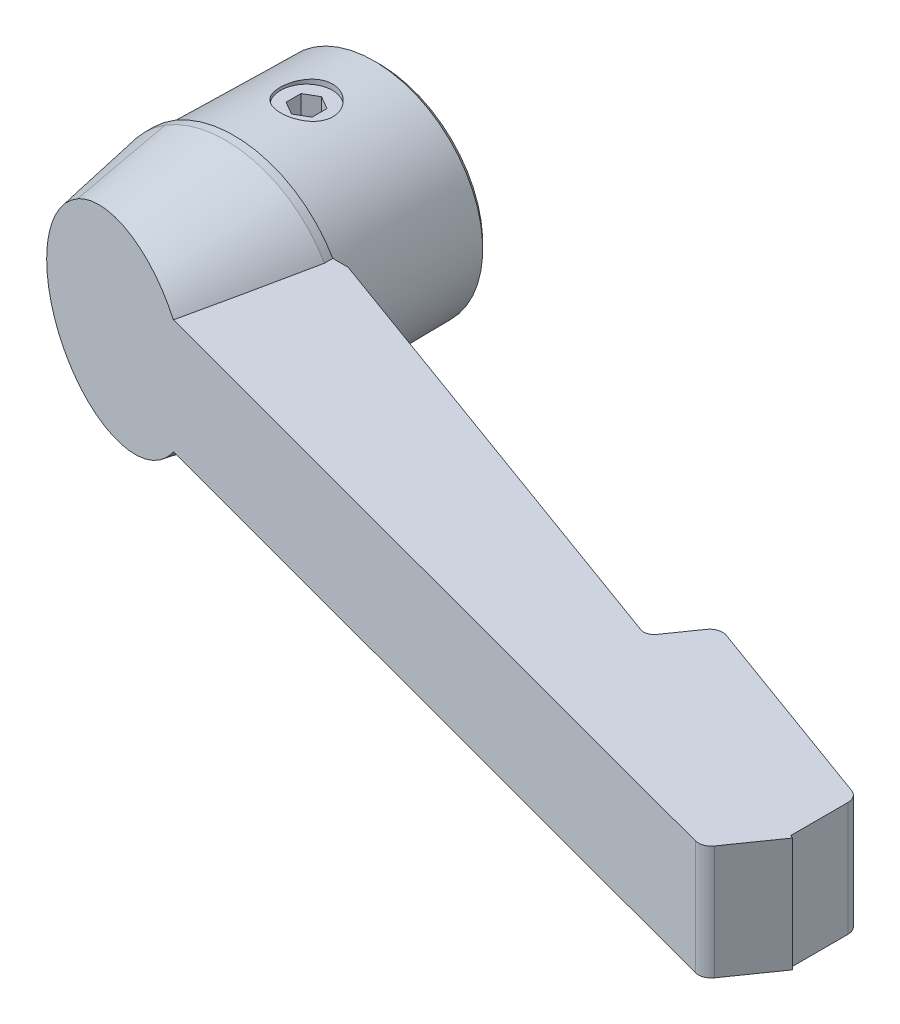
ISO-10303-21;
HEADER;
FILE_DESCRIPTION(('STEP AP214'),'2;1');
FILE_NAME('part.step','',(''),(''),'','','');
FILE_SCHEMA(('AUTOMOTIVE_DESIGN { 1 0 10303 214 1 1 1 1 }'));
ENDSEC;
DATA;
#1=APPLICATION_CONTEXT('core data for automotive mechanical design processes');
#2=APPLICATION_PROTOCOL_DEFINITION('international standard','automotive_design',2000,#1);
#3=PRODUCT_CONTEXT('',#1,'mechanical');
#4=PRODUCT('Part','Part','',(#3));
#5=PRODUCT_RELATED_PRODUCT_CATEGORY('part','',(#4));
#6=PRODUCT_DEFINITION_FORMATION('','',#4);
#7=PRODUCT_DEFINITION_CONTEXT('part definition',#1,'design');
#8=PRODUCT_DEFINITION('design','',#6,#7);
#9=PRODUCT_DEFINITION_SHAPE('','',#8);
#10=(LENGTH_UNIT() NAMED_UNIT(*) SI_UNIT(.MILLI.,.METRE.));
#11=(NAMED_UNIT(*) PLANE_ANGLE_UNIT() SI_UNIT($,.RADIAN.));
#12=(NAMED_UNIT(*) SI_UNIT($,.STERADIAN.) SOLID_ANGLE_UNIT());
#13=UNCERTAINTY_MEASURE_WITH_UNIT(LENGTH_MEASURE(1.E-05),#10,'distance_accuracy_value','');
#14=(GEOMETRIC_REPRESENTATION_CONTEXT(3) GLOBAL_UNCERTAINTY_ASSIGNED_CONTEXT((#13)) GLOBAL_UNIT_ASSIGNED_CONTEXT((#10,
#11,#12)) REPRESENTATION_CONTEXT('',''));
#15=CARTESIAN_POINT('',(0.,0.,0.));
#16=DIRECTION('',(0.,0.,1.));
#17=DIRECTION('',(1.,0.,0.));
#18=AXIS2_PLACEMENT_3D('',#15,#16,#17);
#19=CARTESIAN_POINT('',(0.,20.,7.));
#20=DIRECTION('',(0.,-1.,0.));
#21=DIRECTION('',(1.,0.,0.));
#22=AXIS2_PLACEMENT_3D('',#19,#20,#21);
#23=CYLINDRICAL_SURFACE('',#22,2.5);
#24=CARTESIAN_POINT('',(0.,4.75,7.));
#25=DIRECTION('',(0.,-1.,0.));
#26=DIRECTION('',(0.,0.,-1.));
#27=AXIS2_PLACEMENT_3D('',#24,#25,#26);
#28=CIRCLE('',#27,2.5);
#29=CARTESIAN_POINT('',(0.,4.75,4.5));
#30=VERTEX_POINT('',#29);
#31=EDGE_CURVE('E265',#30,#30,#28,.T.);
#32=ORIENTED_EDGE('',*,*,#31,.F.);
#33=EDGE_LOOP('',(#32));
#34=FACE_BOUND('',#33,.T.);
#35=CARTESIAN_POINT('',(0.,4.,7.));
#36=DIRECTION('',(0.,-1.,0.));
#37=DIRECTION('',(1.,0.,0.));
#38=AXIS2_PLACEMENT_3D('',#35,#36,#37);
#39=CIRCLE('',#38,2.5);
#40=CARTESIAN_POINT('',(2.5,4.,7.));
#41=VERTEX_POINT('',#40);
#42=EDGE_CURVE('E20',#41,#41,#39,.T.);
#43=ORIENTED_EDGE('',*,*,#42,.T.);
#44=EDGE_LOOP('',(#43));
#45=FACE_BOUND('',#44,.T.);
#46=ADVANCED_FACE('F15',(#34,#45),#23,.F.);
#47=CARTESIAN_POINT('',(0.,0.,14.7999999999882));
#48=DIRECTION('',(0.,0.,-1.));
#49=DIRECTION('',(1.,0.,0.));
#50=AXIS2_PLACEMENT_3D('',#47,#48,#49);
#51=CONICAL_SURFACE('',#50,11.,0.174532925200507);
#52=CARTESIAN_POINT('',(-0.43473589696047,0.,24.8212738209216));
#53=DIRECTION('',(-0.25799303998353,0.,0.966146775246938));
#54=DIRECTION('',(-0.966146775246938,0.,-0.25799303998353));
#55=AXIS2_PLACEMENT_3D('',#52,#53,#54);
#56=ELLIPSE('',#55,9.55649729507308,9.22273857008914);
#57=CARTESIAN_POINT('',(-6.11276732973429,-7.27257466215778,23.3050522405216));
#58=VERTEX_POINT('',#57);
#59=CARTESIAN_POINT('',(6.9767881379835,-5.5,26.800395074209));
#60=VERTEX_POINT('',#59);
#61=EDGE_CURVE('E530',#58,#60,#56,.T.);
#62=ORIENTED_EDGE('',*,*,#61,.F.);
#63=CARTESIAN_POINT('',(4.9960036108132E-13,-91.1804199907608,-446.54535948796));
#64=DIRECTION('',(0.,0.984425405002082,-0.175802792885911));
#65=DIRECTION('',(0.,-0.175802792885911,-0.984425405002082));
#66=AXIS2_PLACEMENT_3D('',#63,#64,#65);
#67=ELLIPSE('',#66,525.291053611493,14.6361392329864);
#68=CARTESIAN_POINT('',(-6.61139481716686,-8.79144234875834,14.7999999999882));
#69=VERTEX_POINT('',#68);
#70=EDGE_CURVE('E533',#69,#58,#67,.T.);
#71=ORIENTED_EDGE('',*,*,#70,.F.);
#72=CARTESIAN_POINT('',(0.,0.,14.7999999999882));
#73=DIRECTION('',(0.,0.,1.));
#74=DIRECTION('',(-1.,0.,0.));
#75=AXIS2_PLACEMENT_3D('',#72,#73,#74);
#76=CIRCLE('',#75,11.);
#77=CARTESIAN_POINT('',(9.52627944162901,-5.5,14.7999999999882));
#78=VERTEX_POINT('',#77);
#79=EDGE_CURVE('E382',#69,#78,#76,.T.);
#80=ORIENTED_EDGE('',*,*,#79,.T.);
#81=CARTESIAN_POINT('',(12.328424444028,-5.5,0.623885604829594));
#82=CARTESIAN_POINT('',(12.0480432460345,-5.5,2.0758061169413));
#83=CARTESIAN_POINT('',(11.7662180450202,-5.5,3.52745022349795));
#84=CARTESIAN_POINT('',(11.1987674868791,-5.5,6.42998409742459));
#85=CARTESIAN_POINT('',(10.9131421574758,-5.5,7.88087387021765));
#86=CARTESIAN_POINT('',(10.336394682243,-5.5,10.7856494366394));
#87=CARTESIAN_POINT('',(10.0452597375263,-5.5,12.2395326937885));
#88=CARTESIAN_POINT('',(9.45685634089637,-5.5,15.1460798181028));
#89=CARTESIAN_POINT('',(9.15958780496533,-5.5,16.5987436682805));
#90=CARTESIAN_POINT('',(8.55699087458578,-5.5,19.5021982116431));
#91=CARTESIAN_POINT('',(8.25166359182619,-5.5,20.9529891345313));
#92=CARTESIAN_POINT('',(7.78526717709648,-5.5,23.1273459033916));
#93=CARTESIAN_POINT('',(7.62840363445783,-5.5,23.8518137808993));
#94=CARTESIAN_POINT('',(7.31129954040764,-5.5,25.3000105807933));
#95=CARTESIAN_POINT('',(7.15105899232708,-5.5,26.0237395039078));
#96=CARTESIAN_POINT('',(6.82680195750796,-5.5,27.4688562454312));
#97=CARTESIAN_POINT('',(6.6627935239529,-5.5,28.1902458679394));
#98=CARTESIAN_POINT('',(6.32973241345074,-5.5,29.6318590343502));
#99=CARTESIAN_POINT('',(6.16067976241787,-5.5,30.3520825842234));
#100=CARTESIAN_POINT('',(5.81615298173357,-5.5,31.7911486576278));
#101=CARTESIAN_POINT('',(5.64067756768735,-5.5,32.5099908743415));
#102=CARTESIAN_POINT('',(5.28142326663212,-5.5,33.9456051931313));
#103=CARTESIAN_POINT('',(5.09764446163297,-5.5,34.6623773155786));
#104=CARTESIAN_POINT('',(4.81324608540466,-5.5,35.7362388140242));
#105=CARTESIAN_POINT('',(4.71685843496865,-5.5,36.0944490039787));
#106=CARTESIAN_POINT('',(4.5206871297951,-5.5,36.809928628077));
#107=CARTESIAN_POINT('',(4.42090358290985,-5.5,37.1671980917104));
#108=CARTESIAN_POINT('',(4.21729931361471,-5.5,37.880355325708));
#109=CARTESIAN_POINT('',(4.11348105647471,-5.5,38.2362437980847));
#110=CARTESIAN_POINT('',(3.90078934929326,-5.5,38.9465544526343));
#111=CARTESIAN_POINT('',(3.79191536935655,-5.5,39.3009764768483));
#112=CARTESIAN_POINT('',(3.56751168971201,-5.5,40.0086782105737));
#113=CARTESIAN_POINT('',(3.45196621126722,-5.5,40.3619529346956));
#114=CARTESIAN_POINT('',(3.21254819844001,-5.5,41.0655917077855));
#115=CARTESIAN_POINT('',(3.08867803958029,-5.5,41.4159565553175));
#116=CARTESIAN_POINT('',(2.89413979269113,-5.5,41.9386440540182));
#117=CARTESIAN_POINT('',(2.82776911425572,-5.5,42.1125650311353));
#118=CARTESIAN_POINT('',(2.69154991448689,-5.5,42.4590236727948));
#119=CARTESIAN_POINT('',(2.62170174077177,-5.5,42.6315614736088));
#120=CARTESIAN_POINT('',(2.47771744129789,-5.5,42.9750475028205));
#121=CARTESIAN_POINT('',(2.403577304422,-5.5,43.1459940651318));
#122=CARTESIAN_POINT('',(2.24987262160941,-5.5,43.4854936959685));
#123=CARTESIAN_POINT('',(2.1703062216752,-5.5,43.6540459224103));
#124=CARTESIAN_POINT('',(2.08745314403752,-5.5,43.8210231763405));
#125=B_SPLINE_CURVE_WITH_KNOTS('',3,(#81,#82,#83,#84,#85,#86,#87,#88,#89,#90,#91,#92,#93,#94,
#95,#96,#97,#98,#99,#100,#101,#102,#103,#104,#105,#106,#107,#108,#109,#110,#111,#112,#113,#114,
#115,#116,#117,#118,#119,#120,#121,#122,#123,#124),.UNSPECIFIED.,.F.,.F.,(4,2,2,2,2,2,2,2,2,2,2,
2,2,2,2,2,2,2,2,2,2,4),(0.,4.4362378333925,8.87244332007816,13.3206711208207,17.7689598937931,
22.2166382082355,24.4403988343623,26.6641572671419,28.8835385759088,31.1029084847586,
33.3227246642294,35.5425189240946,36.6553609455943,37.7681676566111,38.880304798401,
39.9925587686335,41.1075606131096,42.2222456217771,42.7806798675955,43.3390584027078,
43.8979674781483,44.4570684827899),.UNSPECIFIED.);
#126=EDGE_CURVE('E368',#78,#60,#125,.T.);
#127=ORIENTED_EDGE('',*,*,#126,.T.);
#128=EDGE_LOOP('',(#62,#71,#80,#127));
#129=FACE_BOUND('',#128,.T.);
#130=ADVANCED_FACE('F17',(#129),#51,.T.);
#131=CARTESIAN_POINT('',(-0.43473589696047,0.,24.8212738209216));
#132=DIRECTION('',(-0.25799303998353,0.,0.966146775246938));
#133=DIRECTION('',(-0.966146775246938,0.,-0.25799303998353));
#134=AXIS2_PLACEMENT_3D('',#131,#132,#133);
#135=ELLIPSE('',#134,9.55649729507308,9.22273857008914);
#136=CARTESIAN_POINT('',(6.9767881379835,5.5,26.800395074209));
#137=VERTEX_POINT('',#136);
#138=CARTESIAN_POINT('',(-5.57630644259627,7.66040255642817,23.4483049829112));
#139=VERTEX_POINT('',#138);
#140=EDGE_CURVE('E521',#137,#139,#135,.T.);
#141=ORIENTED_EDGE('',*,*,#140,.F.);
#142=CARTESIAN_POINT('',(12.328424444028,5.5,0.623885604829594));
#143=CARTESIAN_POINT('',(12.0480432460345,5.5,2.0758061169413));
#144=CARTESIAN_POINT('',(11.7662180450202,5.5,3.52745022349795));
#145=CARTESIAN_POINT('',(11.1987674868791,5.5,6.42998409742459));
#146=CARTESIAN_POINT('',(10.9131421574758,5.5,7.88087387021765));
#147=CARTESIAN_POINT('',(10.336394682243,5.5,10.7856494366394));
#148=CARTESIAN_POINT('',(10.0452597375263,5.5,12.2395326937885));
#149=CARTESIAN_POINT('',(9.45685634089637,5.5,15.1460798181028));
#150=CARTESIAN_POINT('',(9.15958780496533,5.5,16.5987436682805));
#151=CARTESIAN_POINT('',(8.55699087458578,5.5,19.5021982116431));
#152=CARTESIAN_POINT('',(8.25166359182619,5.5,20.9529891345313));
#153=CARTESIAN_POINT('',(7.78526717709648,5.5,23.1273459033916));
#154=CARTESIAN_POINT('',(7.62840363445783,5.5,23.8518137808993));
#155=CARTESIAN_POINT('',(7.31129954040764,5.5,25.3000105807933));
#156=CARTESIAN_POINT('',(7.15105899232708,5.5,26.0237395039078));
#157=CARTESIAN_POINT('',(6.82680195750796,5.5,27.4688562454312));
#158=CARTESIAN_POINT('',(6.6627935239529,5.5,28.1902458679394));
#159=CARTESIAN_POINT('',(6.32973241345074,5.5,29.6318590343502));
#160=CARTESIAN_POINT('',(6.16067976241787,5.5,30.3520825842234));
#161=CARTESIAN_POINT('',(5.81615298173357,5.5,31.7911486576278));
#162=CARTESIAN_POINT('',(5.64067756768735,5.5,32.5099908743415));
#163=CARTESIAN_POINT('',(5.28142326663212,5.5,33.9456051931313));
#164=CARTESIAN_POINT('',(5.09764446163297,5.5,34.6623773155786));
#165=CARTESIAN_POINT('',(4.81324608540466,5.5,35.7362388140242));
#166=CARTESIAN_POINT('',(4.71685843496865,5.5,36.0944490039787));
#167=CARTESIAN_POINT('',(4.5206871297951,5.5,36.809928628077));
#168=CARTESIAN_POINT('',(4.42090358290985,5.5,37.1671980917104));
#169=CARTESIAN_POINT('',(4.21729931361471,5.5,37.880355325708));
#170=CARTESIAN_POINT('',(4.11348105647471,5.5,38.2362437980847));
#171=CARTESIAN_POINT('',(3.90078934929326,5.5,38.9465544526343));
#172=CARTESIAN_POINT('',(3.79191536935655,5.5,39.3009764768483));
#173=CARTESIAN_POINT('',(3.56751168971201,5.5,40.0086782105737));
#174=CARTESIAN_POINT('',(3.45196621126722,5.5,40.3619529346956));
#175=CARTESIAN_POINT('',(3.21254819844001,5.5,41.0655917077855));
#176=CARTESIAN_POINT('',(3.08867803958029,5.5,41.4159565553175));
#177=CARTESIAN_POINT('',(2.89413979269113,5.5,41.9386440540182));
#178=CARTESIAN_POINT('',(2.82776911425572,5.5,42.1125650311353));
#179=CARTESIAN_POINT('',(2.69154991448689,5.5,42.4590236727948));
#180=CARTESIAN_POINT('',(2.62170174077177,5.5,42.6315614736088));
#181=CARTESIAN_POINT('',(2.47771744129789,5.5,42.9750475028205));
#182=CARTESIAN_POINT('',(2.403577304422,5.5,43.1459940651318));
#183=CARTESIAN_POINT('',(2.24987262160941,5.5,43.4854936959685));
#184=CARTESIAN_POINT('',(2.1703062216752,5.5,43.6540459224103));
#185=CARTESIAN_POINT('',(2.08745314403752,5.5,43.8210231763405));
#186=B_SPLINE_CURVE_WITH_KNOTS('',3,(#142,#143,#144,#145,#146,#147,#148,#149,#150,#151,#152,
#153,#154,#155,#156,#157,#158,#159,#160,#161,#162,#163,#164,#165,#166,#167,#168,#169,#170,#171,
#172,#173,#174,#175,#176,#177,#178,#179,#180,#181,#182,#183,#184,#185),.UNSPECIFIED.,.F.,.F.,(4,
2,2,2,2,2,2,2,2,2,2,2,2,2,2,2,2,2,2,2,2,4),(0.,4.4362378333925,8.87244332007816,
13.3206711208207,17.7689598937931,22.2166382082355,24.4403988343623,26.6641572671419,
28.8835385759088,31.1029084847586,33.3227246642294,35.5425189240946,36.6553609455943,
37.7681676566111,38.880304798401,39.9925587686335,41.1075606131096,42.2222456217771,
42.7806798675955,43.3390584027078,43.8979674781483,44.4570684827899),.UNSPECIFIED.);
#187=CARTESIAN_POINT('',(9.52627944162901,5.5,14.7999999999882));
#188=VERTEX_POINT('',#187);
#189=EDGE_CURVE('E360',#188,#137,#186,.T.);
#190=ORIENTED_EDGE('',*,*,#189,.F.);
#191=CARTESIAN_POINT('',(-5.82081728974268,9.33370698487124,14.7999999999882));
#192=VERTEX_POINT('',#191);
#193=EDGE_CURVE('E383',#188,#192,#76,.T.);
#194=ORIENTED_EDGE('',*,*,#193,.T.);
#195=CARTESIAN_POINT('',(0.,13.4102907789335,-6.26941172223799));
#196=DIRECTION('',(0.,-0.981791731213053,-0.189960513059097));
#197=DIRECTION('',(0.,0.189960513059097,-0.981791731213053));
#198=AXIS2_PLACEMENT_3D('',#195,#196,#197);
#199=ELLIPSE('',#198,77.4640240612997,6.05792361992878);
#200=EDGE_CURVE('E529',#139,#192,#199,.T.);
#201=ORIENTED_EDGE('',*,*,#200,.F.);
#202=EDGE_LOOP('',(#141,#190,#194,#201));
#203=FACE_BOUND('',#202,.T.);
#204=ADVANCED_FACE('F527',(#203),#51,.T.);
#205=CARTESIAN_POINT('',(-13.0910090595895,-7.67647141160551,21.04339180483));
#206=DIRECTION('',(0.,0.984425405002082,-0.175802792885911));
#207=DIRECTION('',(0.,0.175802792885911,0.984425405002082));
#208=AXIS2_PLACEMENT_3D('',#205,#206,#207);
#209=PLANE('',#208);
#210=ORIENTED_EDGE('',*,*,#70,.T.);
#211=DIRECTION('',(0.965122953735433,0.0460246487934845,0.2577196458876));
#212=VECTOR('',#211,1.);
#213=CARTESIAN_POINT('',(-13.1932227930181,-7.61022643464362,21.414337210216));
#214=LINE('',#213,#212);
#215=CARTESIAN_POINT('',(-6.10034327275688,-7.27198218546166,23.3083698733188));
#216=VERTEX_POINT('',#215);
#217=EDGE_CURVE('E531',#58,#216,#214,.T.);
#218=ORIENTED_EDGE('',*,*,#217,.T.);
#219=DIRECTION('',(-0.0590259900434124,-0.175496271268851,-0.982709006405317));
#220=VECTOR('',#219,1.);
#221=CARTESIAN_POINT('',(-6.23638819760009,-7.67647141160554,21.04339180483));
#222=LINE('',#221,#220);
#223=EDGE_CURVE('E538',#216,#69,#222,.T.);
#224=ORIENTED_EDGE('',*,*,#223,.T.);
#225=EDGE_LOOP('',(#210,#218,#224));
#226=FACE_BOUND('',#225,.T.);
#227=ADVANCED_FACE('F343',(#226),#209,.T.);
#228=CARTESIAN_POINT('',(-5.62859872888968,8.125713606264,21.04339180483));
#229=DIRECTION('',(0.,-0.981791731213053,-0.189960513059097));
#230=DIRECTION('',(0.,0.189960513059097,-0.981791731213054));
#231=AXIS2_PLACEMENT_3D('',#228,#229,#230);
#232=PLANE('',#231);
#233=DIRECTION('',(0.0302131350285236,-0.189873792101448,0.981343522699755));
#234=VECTOR('',#233,1.);
#235=CARTESIAN_POINT('',(-5.62859872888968,8.125713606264,21.04339180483));
#236=LINE('',#235,#234);
#237=CARTESIAN_POINT('',(-5.55437712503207,7.65926954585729,23.4541608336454));
#238=VERTEX_POINT('',#237);
#239=EDGE_CURVE('E542',#192,#238,#236,.T.);
#240=ORIENTED_EDGE('',*,*,#239,.T.);
#241=DIRECTION('',(-0.964945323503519,0.0498553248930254,-0.257672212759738));
#242=VECTOR('',#241,1.);
#243=CARTESIAN_POINT('',(-6.24533847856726,7.69496908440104,23.2696513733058));
#244=LINE('',#243,#242);
#245=EDGE_CURVE('E39',#238,#139,#244,.T.);
#246=ORIENTED_EDGE('',*,*,#245,.T.);
#247=ORIENTED_EDGE('',*,*,#200,.T.);
#248=EDGE_LOOP('',(#240,#246,#247));
#249=FACE_BOUND('',#248,.T.);
#250=ADVANCED_FACE('F314',(#249),#232,.T.);
#251=CARTESIAN_POINT('',(-8.79824314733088,0.,27.2867836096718));
#252=CARTESIAN_POINT('',(-9.04288279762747,0.,25.899363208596));
#253=CARTESIAN_POINT('',(-9.53216209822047,0.,23.124522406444));
#254=CARTESIAN_POINT('',(-10.2660810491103,0.,18.962261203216));
#255=CARTESIAN_POINT('',(-10.7553603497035,0.,16.1874204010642));
#256=CARTESIAN_POINT('',(-11.,0.,14.7999999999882));
#257=CARTESIAN_POINT('',(-8.79824314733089,-0.0024962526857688,27.2867836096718));
#258=CARTESIAN_POINT('',(-9.04288279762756,-0.00259891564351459,25.8993632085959));
#259=CARTESIAN_POINT('',(-9.5321620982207,-0.00280363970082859,23.1245224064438));
#260=CARTESIAN_POINT('',(-10.2660810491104,-0.00310890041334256,18.9622612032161));
#261=CARTESIAN_POINT('',(-10.7553603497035,-0.00331119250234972,16.1874204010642));
#262=CARTESIAN_POINT('',(-11.0000000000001,-0.00341203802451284,14.7999999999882));
#263=CARTESIAN_POINT('',(-8.79823783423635,-0.0149809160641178,27.2867836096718));
#264=CARTESIAN_POINT('',(-9.04287310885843,-0.0155970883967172,25.8993863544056));
#265=CARTESIAN_POINT('',(-9.53214774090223,-0.0168258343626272,23.1245686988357));
#266=CARTESIAN_POINT('',(-10.2660658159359,-0.0186581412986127,18.9623074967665));
#267=CARTESIAN_POINT('',(-10.755348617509,-0.0198724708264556,16.1874435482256));
#268=CARTESIAN_POINT('',(-10.9999920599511,-0.0204778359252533,14.7999999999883));
#269=CARTESIAN_POINT('',(-8.79798217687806,-0.115084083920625,27.2867836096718));
#270=CARTESIAN_POINT('',(-9.04257612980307,-0.119822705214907,25.8995402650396));
#271=CARTESIAN_POINT('',(-9.53179532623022,-0.129273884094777,23.1248765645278));
#272=CARTESIAN_POINT('',(-10.265671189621,-0.143371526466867,18.9626154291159));
#273=CARTESIAN_POINT('',(-10.7549531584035,-0.15271718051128,16.1875975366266));
#274=CARTESIAN_POINT('',(-10.9996098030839,-0.157376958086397,14.7999999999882));
#275=CARTESIAN_POINT('',(-8.79150682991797,-0.452632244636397,27.2867836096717));
#276=CARTESIAN_POINT('',(-9.03565220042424,-0.471315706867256,25.9000399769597));
#277=CARTESIAN_POINT('',(-9.52406376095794,-0.508600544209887,23.1258766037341));
#278=CARTESIAN_POINT('',(-10.256865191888,-0.564267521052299,18.9636163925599));
#279=CARTESIAN_POINT('',(-10.7455224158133,-0.60120502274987,16.1880983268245));
#280=CARTESIAN_POINT('',(-10.9899116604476,-0.619632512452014,14.7999999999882));
#281=CARTESIAN_POINT('',(-8.60274626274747,-2.96521456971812,27.2867836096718));
#282=CARTESIAN_POINT('',(-8.83558092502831,-3.09017534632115,25.9032782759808));
#283=CARTESIAN_POINT('',(-9.30189992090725,-3.34045305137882,23.1323746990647));
#284=CARTESIAN_POINT('',(-10.0023501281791,-3.71641372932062,18.9701469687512));
#285=CARTESIAN_POINT('',(-10.4699712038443,-3.96742054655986,16.1913745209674));
#286=CARTESIAN_POINT('',(-10.7041135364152,-4.09310587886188,14.7999999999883));
#287=CARTESIAN_POINT('',(-7.47795595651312,-5.11741625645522,27.2867836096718));
#288=CARTESIAN_POINT('',(-7.64737334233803,-5.32504630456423,25.9027189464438));
#289=CARTESIAN_POINT('',(-7.98654176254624,-5.74084263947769,23.1312501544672));
#290=CARTESIAN_POINT('',(-8.49568364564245,-6.36539875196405,18.9690135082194));
#291=CARTESIAN_POINT('',(-8.83537328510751,-6.78234880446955,16.1908047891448));
#292=CARTESIAN_POINT('',(-9.00538771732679,-6.99109701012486,14.7999999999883));
#293=CARTESIAN_POINT('',(-5.86138157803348,-6.56150047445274,27.2867836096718));
#294=CARTESIAN_POINT('',(-5.9447163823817,-6.80927179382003,25.899363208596));
#295=CARTESIAN_POINT('',(-6.11138599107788,-7.30481443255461,23.124522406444));
#296=CARTESIAN_POINT('',(-6.36139040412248,-8.04812839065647,18.9622612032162));
#297=CARTESIAN_POINT('',(-6.52806001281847,-8.54367102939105,16.1874204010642));
#298=CARTESIAN_POINT('',(-6.61139481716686,-8.79144234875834,14.7999999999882));
#299=(BOUNDED_SURFACE() B_SPLINE_SURFACE(3,3,((#251,#252,#253,#254,#255,#256),(#257,#258,#259,
#260,#261,#262),(#263,#264,#265,#266,#267,#268),(#269,#270,#271,#272,#273,#274),(#275,#276,#277,
#278,#279,#280),(#281,#282,#283,#284,#285,#286),(#287,#288,#289,#290,#291,#292),(#293,#294,#295,
#296,#297,#298)),.UNSPECIFIED.,.F.,.F.,.F.) B_SPLINE_SURFACE_WITH_KNOTS((4,1,1,1,1,4),(4,1,1,4),
(0.,0.00104166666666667,0.00520833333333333,0.0416666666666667,0.140625,1.),(0.,
0.333333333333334,0.666666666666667,1.),
.UNSPECIFIED.) GEOMETRIC_REPRESENTATION_ITEM() RATIONAL_B_SPLINE_SURFACE(((1.,1.,1.,1.,1.,1.),
(0.999939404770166,0.999938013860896,0.999935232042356,0.999931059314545,0.999928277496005,
0.999926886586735),(0.999636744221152,0.99962840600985,0.999611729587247,0.999586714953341,
0.999570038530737,0.999561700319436),(0.997228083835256,0.997164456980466,0.997037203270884,
0.996846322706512,0.996719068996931,0.996655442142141),(0.989488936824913,0.989247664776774,
0.988765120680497,0.988041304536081,0.987558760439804,0.987317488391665),(0.942169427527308,
0.940841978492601,0.938187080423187,0.934204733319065,0.931549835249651,0.930222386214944),
(0.950008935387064,0.948861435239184,0.946566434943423,0.943123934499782,0.940828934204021,
0.93968143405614),(1.,1.,1.,1.,1.,1.))) REPRESENTATION_ITEM('') SURFACE());
#300=CARTESIAN_POINT('',(-9.66771494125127,0.,22.3557640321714));
#301=CARTESIAN_POINT('',(-9.6677247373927,-0.188131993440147,22.3557614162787));
#302=CARTESIAN_POINT('',(-9.66194379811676,-0.376261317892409,22.3573051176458));
#303=CARTESIAN_POINT('',(-9.63887129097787,-0.751724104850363,22.363466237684));
#304=CARTESIAN_POINT('',(-9.62158206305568,-0.939057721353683,22.3680830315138));
#305=CARTESIAN_POINT('',(-9.57557460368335,-1.31212780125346,22.3803685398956));
#306=CARTESIAN_POINT('',(-9.54686175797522,-1.49786497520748,22.388035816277));
#307=CARTESIAN_POINT('',(-9.47814807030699,-1.86709075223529,22.4063846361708));
#308=CARTESIAN_POINT('',(-9.43814649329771,-2.05057920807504,22.4170663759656));
#309=CARTESIAN_POINT('',(-9.33128081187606,-2.47752863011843,22.4456030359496));
#310=CARTESIAN_POINT('',(-9.25991082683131,-2.71979644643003,22.4646611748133));
#311=CARTESIAN_POINT('',(-9.09764899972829,-3.19725393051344,22.5079904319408));
#312=CARTESIAN_POINT('',(-9.00675348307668,-3.43244225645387,22.5322625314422));
#313=CARTESIAN_POINT('',(-8.80607832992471,-3.89438600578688,22.5858494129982));
#314=CARTESIAN_POINT('',(-8.69627433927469,-4.12113008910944,22.6151706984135));
#315=CARTESIAN_POINT('',(-8.4587633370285,-4.56432533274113,22.6785939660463));
#316=CARTESIAN_POINT('',(-8.33105824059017,-4.78077759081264,22.7126954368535));
#317=CARTESIAN_POINT('',(-8.10055416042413,-5.13735759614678,22.7742476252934));
#318=CARTESIAN_POINT('',(-8.00212562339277,-5.28053712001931,22.8005312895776));
#319=CARTESIAN_POINT('',(-7.79751653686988,-5.56086001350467,22.8551686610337));
#320=CARTESIAN_POINT('',(-7.69133548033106,-5.69800298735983,22.883522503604));
#321=CARTESIAN_POINT('',(-7.47161398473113,-5.96583511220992,22.942195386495));
#322=CARTESIAN_POINT('',(-7.35807293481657,-6.09652372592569,22.9725145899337));
#323=CARTESIAN_POINT('',(-7.12406997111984,-6.35103462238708,23.0350010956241));
#324=CARTESIAN_POINT('',(-7.00360945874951,-6.4748582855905,23.0671680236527));
#325=CARTESIAN_POINT('',(-6.75617759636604,-6.71530967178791,23.1332404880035));
#326=CARTESIAN_POINT('',(-6.62920664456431,-6.83193783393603,23.1671459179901));
#327=CARTESIAN_POINT('',(-6.36921054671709,-7.05767209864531,23.2365734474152));
#328=CARTESIAN_POINT('',(-6.23618656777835,-7.16677964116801,23.2720952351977));
#329=CARTESIAN_POINT('',(-6.10034327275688,-7.27198218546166,23.3083698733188));
#330=B_SPLINE_CURVE_WITH_KNOTS('',3,(#300,#301,#302,#303,#304,#305,#306,#307,#308,#309,#310,
#311,#312,#313,#314,#315,#316,#317,#318,#319,#320,#321,#322,#323,#324,#325,#326,#327,#328,#329),
.UNSPECIFIED.,.F.,.F.,(4,2,2,2,2,2,2,2,2,2,2,2,2,2,4),(0.,0.564296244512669,1.12847778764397,
1.69239365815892,2.2563462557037,3.0152338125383,3.77426431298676,4.53427986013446,
5.29421415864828,5.82112517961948,6.34807069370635,6.87505999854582,7.40194294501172,
7.92879370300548,8.4555433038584),.UNSPECIFIED.);
#331=CARTESIAN_POINT('',(-9.66771494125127,0.,22.3557640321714));
#332=VERTEX_POINT('',#331);
#333=EDGE_CURVE('E323',#332,#216,#330,.T.);
#334=DIRECTION('',(0.173648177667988,0.,0.984807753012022));
#335=VECTOR('',#334,1.);
#336=CARTESIAN_POINT('',(-9.89912157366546,0.,21.04339180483));
#337=LINE('',#336,#335);
#338=CARTESIAN_POINT('',(-11.,0.,14.7999999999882));
#339=VERTEX_POINT('',#338);
#340=EDGE_CURVE('E539',#339,#332,#337,.T.);
#341=EDGE_CURVE('E378',#339,#69,#76,.T.);
#342=ORIENTED_EDGE('',*,*,#333,.F.);
#343=ORIENTED_EDGE('',*,*,#340,.F.);
#344=ORIENTED_EDGE('',*,*,#341,.T.);
#345=ORIENTED_EDGE('',*,*,#223,.F.);
#346=EDGE_LOOP('',(#342,#343,#344,#345));
#347=FACE_BOUND('',#346,.T.);
#348=ADVANCED_FACE('F334',(#347),#299,.F.);
#349=CARTESIAN_POINT('',(-5.43638016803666,6.91772022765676,27.2867836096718));
#350=CARTESIAN_POINT('',(-5.47909540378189,7.18616320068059,25.899363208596));
#351=CARTESIAN_POINT('',(-5.56452587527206,7.72304914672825,23.124522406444));
#352=CARTESIAN_POINT('',(-5.69267158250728,8.52837806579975,18.9622612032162));
#353=CARTESIAN_POINT('',(-5.77810205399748,9.0652640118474,16.1874204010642));
#354=CARTESIAN_POINT('',(-5.82081728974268,9.33370698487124,14.7999999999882));
#355=CARTESIAN_POINT('',(-7.27464730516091,5.47309415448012,27.2867836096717));
#356=CARTESIAN_POINT('',(-7.42344296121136,5.70746544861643,25.9040591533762));
#357=CARTESIAN_POINT('',(-7.72140405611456,6.17704191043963,23.1339461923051));
#358=CARTESIAN_POINT('',(-8.16870358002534,6.88273165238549,18.9717332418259));
#359=CARTESIAN_POINT('',(-8.46714471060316,7.35408543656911,16.1921726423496));
#360=CARTESIAN_POINT('',(-8.61655425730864,7.59019027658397,14.7999999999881));
#361=CARTESIAN_POINT('',(-8.57233737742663,3.19565733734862,27.2867836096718));
#362=CARTESIAN_POINT('',(-8.80181300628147,3.33966733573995,25.9048497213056));
#363=CARTESIAN_POINT('',(-9.26165830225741,3.62826116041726,23.1355389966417));
#364=CARTESIAN_POINT('',(-9.95276304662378,4.06202953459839,18.9733437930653));
#365=CARTESIAN_POINT('',(-10.4144032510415,4.35180175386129,16.19298391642));
#366=CARTESIAN_POINT('',(-10.6456838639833,4.4969835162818,14.7999999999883));
#367=CARTESIAN_POINT('',(-8.79051946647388,0.484828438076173,27.2867836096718));
#368=CARTESIAN_POINT('',(-9.03452084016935,0.506088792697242,25.9003038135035));
#369=CARTESIAN_POINT('',(-9.52269208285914,0.548476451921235,23.1264048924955));
#370=CARTESIAN_POINT('',(-10.2552068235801,0.611636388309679,18.9641456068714));
#371=CARTESIAN_POINT('',(-10.7437223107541,0.653461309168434,16.1883632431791));
#372=CARTESIAN_POINT('',(-10.9880647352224,0.674306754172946,14.7999999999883));
#373=CARTESIAN_POINT('',(-8.79794428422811,0.123173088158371,27.2867836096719));
#374=CARTESIAN_POINT('',(-9.04252239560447,0.128557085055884,25.899608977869));
#375=CARTESIAN_POINT('',(-9.53172207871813,0.139283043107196,23.1250140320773));
#376=CARTESIAN_POINT('',(-10.2655870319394,0.155244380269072,18.962752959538));
#377=CARTESIAN_POINT('',(-10.7548739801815,0.165800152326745,16.1876663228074));
#378=CARTESIAN_POINT('',(-10.9995392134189,0.171056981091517,14.7999999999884));
#379=CARTESIAN_POINT('',(-8.79823706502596,0.0160289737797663,27.2867836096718));
#380=CARTESIAN_POINT('',(-9.04287068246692,0.0167286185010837,25.8993953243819));
#381=CARTESIAN_POINT('',(-9.53214358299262,0.0181221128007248,23.1245866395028));
#382=CARTESIAN_POINT('',(-10.2660614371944,0.0201949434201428,18.9623254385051));
#383=CARTESIAN_POINT('',(-10.7553456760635,0.0215652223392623,16.1874525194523));
#384=CARTESIAN_POINT('',(-10.9999906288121,0.0222474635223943,14.7999999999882));
#385=CARTESIAN_POINT('',(-8.79824314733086,0.00267079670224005,27.2867836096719));
#386=CARTESIAN_POINT('',(-9.04288279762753,0.00278736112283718,25.8993632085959));
#387=CARTESIAN_POINT('',(-9.53216209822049,0.00301952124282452,23.1245224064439));
#388=CARTESIAN_POINT('',(-10.2660810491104,0.00336482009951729,18.962261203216));
#389=CARTESIAN_POINT('',(-10.7553603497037,0.00359306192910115,16.1874204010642));
#390=CARTESIAN_POINT('',(-11.0000000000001,0.00370669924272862,14.7999999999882));
#391=CARTESIAN_POINT('',(-8.79824314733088,0.,27.2867836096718));
#392=CARTESIAN_POINT('',(-9.04288279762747,0.,25.899363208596));
#393=CARTESIAN_POINT('',(-9.53216209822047,0.,23.124522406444));
#394=CARTESIAN_POINT('',(-10.2660810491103,0.,18.962261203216));
#395=CARTESIAN_POINT('',(-10.7553603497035,0.,16.1874204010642));
#396=CARTESIAN_POINT('',(-11.,0.,14.7999999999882));
#397=(BOUNDED_SURFACE() B_SPLINE_SURFACE(3,3,((#349,#350,#351,#352,#353,#354),(#355,#356,#357,
#358,#359,#360),(#361,#362,#363,#364,#365,#366),(#367,#368,#369,#370,#371,#372),(#373,#374,#375,
#376,#377,#378),(#379,#380,#381,#382,#383,#384),(#385,#386,#387,#388,#389,#390),(#391,#392,#393,
#394,#395,#396)),.UNSPECIFIED.,.F.,.F.,.F.) B_SPLINE_SURFACE_WITH_KNOTS((4,1,1,1,1,4),(4,1,1,4),
(0.,0.859375,0.958333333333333,0.994791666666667,0.998958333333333,1.),(0.,0.333333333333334,
0.666666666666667,1.),
.UNSPECIFIED.) GEOMETRIC_REPRESENTATION_ITEM() RATIONAL_B_SPLINE_SURFACE(((1.,1.,1.,1.,1.,1.),
(0.942373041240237,0.940780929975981,0.937596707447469,0.932820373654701,0.929636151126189,
0.928044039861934),(0.933336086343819,0.93149430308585,0.927810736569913,0.922285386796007,
0.918601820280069,0.9167600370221),(0.987883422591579,0.987548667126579,0.986879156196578,
0.985874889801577,0.985205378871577,0.984870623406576),(0.996804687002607,0.996716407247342,
0.996539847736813,0.996275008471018,0.996098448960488,0.996010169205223),(0.999581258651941,
0.999569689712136,0.999546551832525,0.99951184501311,0.999488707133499,0.999477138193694),
(0.999930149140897,0.999928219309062,0.999924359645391,0.999918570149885,0.999914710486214,
0.999912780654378),(1.,1.,1.,1.,1.,1.))) REPRESENTATION_ITEM('') SURFACE());
#398=CARTESIAN_POINT('',(-5.55437712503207,7.65926954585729,23.4541608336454));
#399=CARTESIAN_POINT('',(-5.7069738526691,7.55807720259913,23.413412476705));
#400=CARTESIAN_POINT('',(-5.85665709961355,7.45227593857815,23.3734421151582));
#401=CARTESIAN_POINT('',(-6.14970462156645,7.23172028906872,23.2951887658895));
#402=CARTESIAN_POINT('',(-6.29306968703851,7.11696702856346,23.2569055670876));
#403=CARTESIAN_POINT('',(-6.71338968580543,6.75931005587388,23.1446662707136));
#404=CARTESIAN_POINT('',(-6.98014880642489,6.50328768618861,23.0734327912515));
#405=CARTESIAN_POINT('',(-7.40364790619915,6.04459388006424,22.960344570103));
#406=CARTESIAN_POINT('',(-7.56879350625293,5.8501103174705,22.9162452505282));
#407=CARTESIAN_POINT('',(-7.88280444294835,5.44741371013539,22.8323939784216));
#408=CARTESIAN_POINT('',(-8.03166661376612,5.23919800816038,22.7926428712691));
#409=CARTESIAN_POINT('',(-8.31188792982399,4.81037452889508,22.7178145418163));
#410=CARTESIAN_POINT('',(-8.44323881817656,4.58976097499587,22.6827395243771));
#411=CARTESIAN_POINT('',(-8.68725902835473,4.13774627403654,22.6175780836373));
#412=CARTESIAN_POINT('',(-8.7999299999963,3.90634608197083,22.5874912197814));
#413=CARTESIAN_POINT('',(-9.00536228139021,3.43500231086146,22.5326340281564));
#414=CARTESIAN_POINT('',(-9.09817572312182,3.19508307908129,22.5078497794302));
#415=CARTESIAN_POINT('',(-9.26346213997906,2.70785301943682,22.4637128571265));
#416=CARTESIAN_POINT('',(-9.33593569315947,2.46054240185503,22.4443600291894));
#417=CARTESIAN_POINT('',(-9.4598042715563,1.960766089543,22.4112830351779));
#418=CARTESIAN_POINT('',(-9.51123334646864,1.70830942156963,22.3975497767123));
#419=CARTESIAN_POINT('',(-9.59270308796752,1.19983929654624,22.3757946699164));
#420=CARTESIAN_POINT('',(-9.6227565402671,0.943828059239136,22.3677694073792));
#421=CARTESIAN_POINT('',(-9.65057899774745,0.572658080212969,22.3603398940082));
#422=CARTESIAN_POINT('',(-9.65700901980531,0.458135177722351,22.35862286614));
#423=CARTESIAN_POINT('',(-9.66557379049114,0.229079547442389,22.3563357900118));
#424=CARTESIAN_POINT('',(-9.66771459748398,0.114547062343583,22.3557641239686));
#425=CARTESIAN_POINT('',(-9.66771494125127,0.,22.3557640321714));
#426=B_SPLINE_CURVE_WITH_KNOTS('',3,(#398,#399,#400,#401,#402,#403,#404,#405,#406,#407,#408,
#409,#410,#411,#412,#413,#414,#415,#416,#417,#418,#419,#420,#421,#422,#423,#424,#425),
.UNSPECIFIED.,.F.,.F.,(4,2,2,2,2,2,2,2,2,2,2,2,2,4),(0.,0.562549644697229,1.12502870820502,
2.25152778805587,3.02750196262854,3.80362673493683,4.58011617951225,5.35653700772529,
6.13089378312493,6.90522854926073,7.67830544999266,8.45091954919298,8.79499652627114,
9.13858716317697),.UNSPECIFIED.);
#427=EDGE_CURVE('E9',#238,#332,#426,.T.);
#428=EDGE_CURVE('E377',#192,#339,#76,.T.);
#429=ORIENTED_EDGE('',*,*,#427,.F.);
#430=ORIENTED_EDGE('',*,*,#239,.F.);
#431=ORIENTED_EDGE('',*,*,#428,.T.);
#432=ORIENTED_EDGE('',*,*,#340,.T.);
#433=EDGE_LOOP('',(#429,#430,#431,#432));
#434=FACE_BOUND('',#433,.T.);
#435=ADVANCED_FACE('F341',(#434),#397,.F.);
#436=CARTESIAN_POINT('',(-9.96435662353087,0.,0.));
#437=DIRECTION('',(0.,0.,-1.));
#438=DIRECTION('',(1.,0.,0.));
#439=AXIS2_PLACEMENT_3D('',#436,#437,#438);
#440=PLANE('',#439);
#441=DIRECTION('',(0.,1.,0.));
#442=VECTOR('',#441,1.);
#443=CARTESIAN_POINT('',(-4.00000000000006,-4.,0.));
#444=LINE('',#443,#442);
#445=CARTESIAN_POINT('',(-4.00000000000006,-4.,0.));
#446=VERTEX_POINT('',#445);
#447=CARTESIAN_POINT('',(-4.00000000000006,4.,0.));
#448=VERTEX_POINT('',#447);
#449=EDGE_CURVE('E32',#446,#448,#444,.T.);
#450=ORIENTED_EDGE('',*,*,#449,.F.);
#451=DIRECTION('',(1.,0.,0.));
#452=VECTOR('',#451,1.);
#453=CARTESIAN_POINT('',(-4.00000000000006,-4.,0.));
#454=LINE('',#453,#452);
#455=CARTESIAN_POINT('',(4.,-4.,0.));
#456=VERTEX_POINT('',#455);
#457=EDGE_CURVE('E592',#446,#456,#454,.T.);
#458=ORIENTED_EDGE('',*,*,#457,.T.);
#459=DIRECTION('',(0.,-1.,0.));
#460=VECTOR('',#459,1.);
#461=CARTESIAN_POINT('',(4.,4.,0.));
#462=LINE('',#461,#460);
#463=CARTESIAN_POINT('',(4.,4.,0.));
#464=VERTEX_POINT('',#463);
#465=EDGE_CURVE('E607',#464,#456,#462,.T.);
#466=ORIENTED_EDGE('',*,*,#465,.F.);
#467=DIRECTION('',(-1.,0.,0.));
#468=VECTOR('',#467,1.);
#469=CARTESIAN_POINT('',(4.,4.,0.));
#470=LINE('',#469,#468);
#471=EDGE_CURVE('E610',#464,#448,#470,.T.);
#472=ORIENTED_EDGE('',*,*,#471,.T.);
#473=EDGE_LOOP('',(#450,#458,#466,#472));
#474=FACE_BOUND('',#473,.T.);
#475=CARTESIAN_POINT('',(0.,0.,0.));
#476=DIRECTION('',(0.,0.,1.));
#477=DIRECTION('',(-1.,0.,0.));
#478=AXIS2_PLACEMENT_3D('',#475,#476,#477);
#479=CIRCLE('',#478,9.96435662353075);
#480=CARTESIAN_POINT('',(-9.96435662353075,0.,0.));
#481=VERTEX_POINT('',#480);
#482=EDGE_CURVE('E393',#481,#481,#479,.T.);
#483=ORIENTED_EDGE('',*,*,#482,.F.);
#484=EDGE_LOOP('',(#483));
#485=FACE_BOUND('',#484,.T.);
#486=ADVANCED_FACE('F608',(#474,#485),#440,.T.);
#487=CARTESIAN_POINT('',(0.,0.,0.499999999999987));
#488=DIRECTION('',(0.,0.,1.));
#489=DIRECTION('',(-1.,0.,0.));
#490=AXIS2_PLACEMENT_3D('',#487,#488,#489);
#491=CONICAL_SURFACE('',#490,10.4643566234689,0.785398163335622);
#492=ORIENTED_EDGE('',*,*,#482,.T.);
#493=EDGE_LOOP('',(#492));
#494=FACE_BOUND('',#493,.T.);
#495=CARTESIAN_POINT('',(0.,0.,0.499999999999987));
#496=DIRECTION('',(0.,0.,1.));
#497=DIRECTION('',(-1.,0.,0.));
#498=AXIS2_PLACEMENT_3D('',#495,#496,#497);
#499=CIRCLE('',#498,10.4643566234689);
#500=CARTESIAN_POINT('',(-10.4643566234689,0.,0.49999999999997));
#501=VERTEX_POINT('',#500);
#502=EDGE_CURVE('E390',#501,#501,#499,.T.);
#503=ORIENTED_EDGE('',*,*,#502,.F.);
#504=EDGE_LOOP('',(#503));
#505=FACE_BOUND('',#504,.T.);
#506=ADVANCED_FACE('F613',(#494,#505),#491,.T.);
#507=CARTESIAN_POINT('',(0.,0.,14.));
#508=DIRECTION('',(0.,0.,1.));
#509=DIRECTION('',(-1.,0.,0.));
#510=AXIS2_PLACEMENT_3D('',#507,#508,#509);
#511=CONICAL_SURFACE('',#510,10.6999999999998,0.0174532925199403);
#512=CARTESIAN_POINT('',(-1.78622753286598,10.3949307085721,5.250888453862));
#513=CARTESIAN_POINT('',(-1.88382089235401,10.3799261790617,5.35055752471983));
#514=CARTESIAN_POINT('',(-1.97310413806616,10.3650858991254,5.45845636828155));
#515=CARTESIAN_POINT('',(-2.1325663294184,10.337547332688,5.68786705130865));
#516=CARTESIAN_POINT('',(-2.20273523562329,10.3248501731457,5.80938599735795));
#517=CARTESIAN_POINT('',(-2.32192642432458,10.3032374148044,6.06283655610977));
#518=CARTESIAN_POINT('',(-2.37093271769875,10.2943246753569,6.19477595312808));
#519=CARTESIAN_POINT('',(-2.44615841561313,10.2815632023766,6.46521172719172));
#520=CARTESIAN_POINT('',(-2.47238390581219,10.2777131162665,6.60370634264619));
#521=CARTESIAN_POINT('',(-2.50096120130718,10.2757723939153,6.88069247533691));
#522=CARTESIAN_POINT('',(-2.50372764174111,10.2775809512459,7.01914059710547));
#523=CARTESIAN_POINT('',(-2.48643107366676,10.2867221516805,7.29441321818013));
#524=CARTESIAN_POINT('',(-2.46636821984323,10.2940547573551,7.43123772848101));
#525=CARTESIAN_POINT('',(-2.40436138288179,10.3134993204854,7.69836138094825));
#526=CARTESIAN_POINT('',(-2.3625843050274,10.3255746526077,7.82870210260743));
#527=CARTESIAN_POINT('',(-2.25854804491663,10.3533261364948,8.08052177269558));
#528=CARTESIAN_POINT('',(-2.19628613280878,10.3690027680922,8.20199953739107));
#529=CARTESIAN_POINT('',(-2.05138116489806,10.4028081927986,8.4356759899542));
#530=CARTESIAN_POINT('',(-1.96830429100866,10.4209848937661,8.54759870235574));
#531=CARTESIAN_POINT('',(-1.78477003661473,10.4576724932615,8.75610120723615));
#532=CARTESIAN_POINT('',(-1.68431022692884,10.4761834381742,8.8526788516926));
#533=CARTESIAN_POINT('',(-1.46644129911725,10.5120348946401,9.02968798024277));
#534=CARTESIAN_POINT('',(-1.34873550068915,10.5293449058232,9.10976118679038));
#535=CARTESIAN_POINT('',(-1.10110213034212,10.5605538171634,9.24894224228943));
#536=CARTESIAN_POINT('',(-0.97117569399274,10.5744530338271,9.30805203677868));
#537=CARTESIAN_POINT('',(-0.704538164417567,10.5971921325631,9.40278511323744));
#538=CARTESIAN_POINT('',(-0.567939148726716,10.60609632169,9.43870786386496));
#539=CARTESIAN_POINT('',(-0.290405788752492,10.6181630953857,9.48706557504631));
#540=CARTESIAN_POINT('',(-0.14947226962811,10.62132676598,9.49950497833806));
#541=CARTESIAN_POINT('',(0.128677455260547,10.621567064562,9.50045318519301));
#542=CARTESIAN_POINT('',(0.265891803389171,10.6188049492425,9.48959595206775));
#543=CARTESIAN_POINT('',(0.536467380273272,10.6078093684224,9.44560614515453));
#544=CARTESIAN_POINT('',(0.669828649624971,10.5995759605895,9.41247380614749));
#545=CARTESIAN_POINT('',(0.928766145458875,10.578499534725,9.32508830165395));
#546=CARTESIAN_POINT('',(1.05435592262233,10.5656648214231,9.27087317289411));
#547=CARTESIAN_POINT('',(1.29474941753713,10.5366592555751,9.14293517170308));
#548=CARTESIAN_POINT('',(1.40955153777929,10.5204879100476,9.06920941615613));
#549=CARTESIAN_POINT('',(1.62827097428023,10.4859424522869,8.9021438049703));
#550=CARTESIAN_POINT('',(1.73183475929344,10.4675225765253,8.80835048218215));
#551=CARTESIAN_POINT('',(1.92194196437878,10.4306809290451,8.60484679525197));
#552=CARTESIAN_POINT('',(2.00848310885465,10.4122591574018,8.4951343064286));
#553=CARTESIAN_POINT('',(2.16357139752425,10.3769722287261,8.26058101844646));
#554=CARTESIAN_POINT('',(2.23177736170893,10.3601399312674,8.13550919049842));
#555=CARTESIAN_POINT('',(2.34609661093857,10.3301951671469,7.87522945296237));
#556=CARTESIAN_POINT('',(2.3922126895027,10.3170822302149,7.74002282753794));
#557=CARTESIAN_POINT('',(2.46026879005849,10.2961389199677,7.46555949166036));
#558=CARTESIAN_POINT('',(2.48258327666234,10.2882274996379,7.32640199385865));
#559=CARTESIAN_POINT('',(2.50352020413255,10.2781183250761,7.04611925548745));
#560=CARTESIAN_POINT('',(2.50214664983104,10.2759196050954,6.90499435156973));
#561=CARTESIAN_POINT('',(2.47604491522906,10.2772744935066,6.62850735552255));
#562=CARTESIAN_POINT('',(2.45189792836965,10.2806865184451,6.49308920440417));
#563=CARTESIAN_POINT('',(2.38183618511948,10.2923976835,6.2282339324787));
#564=CARTESIAN_POINT('',(2.33592062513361,10.3006970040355,6.09879703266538));
#565=CARTESIAN_POINT('',(2.2234733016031,10.3210909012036,5.84890489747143));
#566=CARTESIAN_POINT('',(2.15685722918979,10.3332010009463,5.72848893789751));
#567=CARTESIAN_POINT('',(2.00495265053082,10.3596888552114,5.50034911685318));
#568=CARTESIAN_POINT('',(1.91966138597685,10.3740669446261,5.39262713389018));
#569=CARTESIAN_POINT('',(1.7303892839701,10.4037478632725,5.19018967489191));
#570=CARTESIAN_POINT('',(1.62600594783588,10.419064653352,5.09585224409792));
#571=CARTESIAN_POINT('',(1.40279898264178,10.4484626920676,4.92591439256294));
#572=CARTESIAN_POINT('',(1.28397473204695,10.4625438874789,4.85031477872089));
#573=CARTESIAN_POINT('',(1.03430922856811,10.4878825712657,4.71961071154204));
#574=CARTESIAN_POINT('',(0.903398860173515,10.4991222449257,4.66463456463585));
#575=CARTESIAN_POINT('',(0.633900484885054,10.5173092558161,4.57756019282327));
#576=CARTESIAN_POINT('',(0.495313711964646,10.5242572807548,4.54545830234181));
#577=CARTESIAN_POINT('',(0.217260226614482,10.5329342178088,4.50557758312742));
#578=CARTESIAN_POINT('',(0.077862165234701,10.5347613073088,4.49734110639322));
#579=CARTESIAN_POINT('',(-0.200344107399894,10.5332626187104,4.50415930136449));
#580=CARTESIAN_POINT('',(-0.339152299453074,10.5299366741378,4.51921472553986));
#581=CARTESIAN_POINT('',(-0.61046809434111,10.518595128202,4.57179110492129));
#582=CARTESIAN_POINT('',(-0.743031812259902,10.510637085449,4.60903645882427));
#583=CARTESIAN_POINT('',(-0.999975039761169,10.4909860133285,4.70460812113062));
#584=CARTESIAN_POINT('',(-1.12435811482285,10.4792946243,4.76292517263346));
#585=CARTESIAN_POINT('',(-1.34272739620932,10.4555637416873,4.8880565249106));
#586=CARTESIAN_POINT('',(-1.43839638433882,10.4438777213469,4.95202846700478));
#587=CARTESIAN_POINT('',(-1.61999525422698,10.419734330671,5.09243862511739));
#588=CARTESIAN_POINT('',(-1.70592458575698,10.4072769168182,5.16887754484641));
#589=CARTESIAN_POINT('',(-1.78622753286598,10.3949307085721,5.250888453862));
#590=B_SPLINE_CURVE_WITH_KNOTS('',3,(#512,#513,#514,#515,#516,#517,#518,#519,#520,#521,#522,
#523,#524,#525,#526,#527,#528,#529,#530,#531,#532,#533,#534,#535,#536,#537,#538,#539,#540,#541,
#542,#543,#544,#545,#546,#547,#548,#549,#550,#551,#552,#553,#554,#555,#556,#557,#558,#559,#560,
#561,#562,#563,#564,#565,#566,#567,#568,#569,#570,#571,#572,#573,#574,#575,#576,#577,#578,#579,
#580,#581,#582,#583,#584,#585,#586,#587,#588,#589),.UNSPECIFIED.,.T.,.F.,(4,2,2,2,2,2,2,2,2,2,2,
2,2,2,2,2,2,2,2,2,2,2,2,2,2,2,2,2,2,2,2,2,2,2,2,2,2,2,4),(0.,0.420489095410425,
0.841198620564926,1.26222545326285,1.6831397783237,2.09659865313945,2.51005472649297,
2.92037878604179,3.33075754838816,3.75052791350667,4.17035698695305,4.59851383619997,
5.02663093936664,5.44910185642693,5.87149283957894,6.28253546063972,6.69357374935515,
7.10387387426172,7.51423466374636,7.9350919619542,8.35600548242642,8.78428062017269,
9.21250158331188,9.63388132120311,10.0551898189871,10.4660291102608,10.8768835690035,
11.2894337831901,11.7020449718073,12.1246459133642,12.547265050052,12.97247149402,
13.3976097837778,13.8145397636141,14.2314832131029,14.6433530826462,15.0550422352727,
15.4010146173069,15.7470065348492),.UNSPECIFIED.);
#591=CARTESIAN_POINT('',(-1.78622753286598,10.3949307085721,5.250888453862));
#592=VERTEX_POINT('',#591);
#593=EDGE_CURVE('E271',#592,#592,#590,.T.);
#594=ORIENTED_EDGE('',*,*,#593,.F.);
#595=EDGE_LOOP('',(#594));
#596=FACE_BOUND('',#595,.T.);
#597=ORIENTED_EDGE('',*,*,#502,.T.);
#598=EDGE_LOOP('',(#597));
#599=FACE_BOUND('',#598,.T.);
#600=CARTESIAN_POINT('',(0.,0.,14.));
#601=DIRECTION('',(0.,0.,1.));
#602=DIRECTION('',(-1.,0.,0.));
#603=AXIS2_PLACEMENT_3D('',#600,#601,#602);
#604=CIRCLE('',#603,10.6999999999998);
#605=CARTESIAN_POINT('',(-10.6999999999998,0.,14.));
#606=VERTEX_POINT('',#605);
#607=EDGE_CURVE('E386',#606,#606,#604,.T.);
#608=ORIENTED_EDGE('',*,*,#607,.F.);
#609=EDGE_LOOP('',(#608));
#610=FACE_BOUND('',#609,.T.);
#611=ADVANCED_FACE('F280',(#596,#599,#610),#511,.T.);
#612=CARTESIAN_POINT('',(-10.6999999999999,0.,14.));
#613=DIRECTION('',(0.,0.,1.));
#614=DIRECTION('',(-1.,0.,0.));
#615=AXIS2_PLACEMENT_3D('',#612,#613,#614);
#616=PLANE('',#615);
#617=CARTESIAN_POINT('',(0.,0.,14.));
#618=DIRECTION('',(0.,0.,1.));
#619=DIRECTION('',(-1.,0.,0.));
#620=AXIS2_PLACEMENT_3D('',#617,#618,#619);
#621=CIRCLE('',#620,11.);
#622=CARTESIAN_POINT('',(9.52627944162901,-5.5,13.9999999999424));
#623=VERTEX_POINT('',#622);
#624=CARTESIAN_POINT('',(11.,0.,14.));
#625=VERTEX_POINT('',#624);
#626=EDGE_CURVE('E384',#623,#625,#621,.T.);
#627=ORIENTED_EDGE('',*,*,#626,.F.);
#628=CARTESIAN_POINT('',(9.52627944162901,5.5,14.));
#629=VERTEX_POINT('',#628);
#630=EDGE_CURVE('E381',#629,#623,#621,.T.);
#631=ORIENTED_EDGE('',*,*,#630,.F.);
#632=EDGE_CURVE('E387',#625,#629,#621,.T.);
#633=ORIENTED_EDGE('',*,*,#632,.F.);
#634=EDGE_LOOP('',(#627,#631,#633));
#635=FACE_BOUND('',#634,.T.);
#636=ORIENTED_EDGE('',*,*,#607,.T.);
#637=EDGE_LOOP('',(#636));
#638=FACE_BOUND('',#637,.T.);
#639=ADVANCED_FACE('F421',(#635,#638),#616,.F.);
#640=CARTESIAN_POINT('',(0.,0.,30.1125597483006));
#641=DIRECTION('',(0.,0.,1.));
#642=DIRECTION('',(-1.,0.,0.));
#643=AXIS2_PLACEMENT_3D('',#640,#641,#642);
#644=CYLINDRICAL_SURFACE('',#643,11.);
#645=DIRECTION('',(0.,0.,1.));
#646=VECTOR('',#645,1.);
#647=CARTESIAN_POINT('',(9.52627944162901,-5.5,30.1125597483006));
#648=LINE('',#647,#646);
#649=EDGE_CURVE('E25',#78,#623,#648,.F.);
#650=ORIENTED_EDGE('',*,*,#649,.F.);
#651=ORIENTED_EDGE('',*,*,#79,.F.);
#652=ORIENTED_EDGE('',*,*,#341,.F.);
#653=ORIENTED_EDGE('',*,*,#428,.F.);
#654=ORIENTED_EDGE('',*,*,#193,.F.);
#655=DIRECTION('',(0.,0.,1.));
#656=VECTOR('',#655,1.);
#657=CARTESIAN_POINT('',(9.52627944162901,5.5,30.1125597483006));
#658=LINE('',#657,#656);
#659=EDGE_CURVE('E396',#188,#629,#658,.F.);
#660=ORIENTED_EDGE('',*,*,#659,.T.);
#661=ORIENTED_EDGE('',*,*,#630,.T.);
#662=EDGE_LOOP('',(#650,#651,#652,#653,#654,#660,#661));
#663=FACE_BOUND('',#662,.T.);
#664=ADVANCED_FACE('F417',(#663),#644,.T.);
#665=CARTESIAN_POINT('',(55.3139673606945,-5.5,30.1289650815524));
#666=DIRECTION('',(0.342020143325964,0.,-0.939692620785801));
#667=DIRECTION('',(0.939692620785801,0.,0.342020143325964));
#668=AXIS2_PLACEMENT_3D('',#665,#666,#667);
#669=PLANE('',#668);
#670=DIRECTION('',(0.,1.,0.));
#671=VECTOR('',#670,1.);
#672=CARTESIAN_POINT('',(55.3139673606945,-5.5,30.1289650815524));
#673=LINE('',#672,#671);
#674=CARTESIAN_POINT('',(55.3139673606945,-5.5,30.1289650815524));
#675=VERTEX_POINT('',#674);
#676=CARTESIAN_POINT('',(55.3139673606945,5.5,30.1289650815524));
#677=VERTEX_POINT('',#676);
#678=EDGE_CURVE('E431',#675,#677,#673,.T.);
#679=ORIENTED_EDGE('',*,*,#678,.F.);
#680=DIRECTION('',(-0.939692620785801,0.,-0.342020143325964));
#681=VECTOR('',#680,1.);
#682=CARTESIAN_POINT('',(55.3139673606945,-5.5,30.1289650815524));
#683=LINE('',#682,#681);
#684=CARTESIAN_POINT('',(11.,-5.5,14.));
#685=VERTEX_POINT('',#684);
#686=EDGE_CURVE('E413',#675,#685,#683,.T.);
#687=ORIENTED_EDGE('',*,*,#686,.T.);
#688=DIRECTION('',(0.,1.,0.));
#689=VECTOR('',#688,1.);
#690=CARTESIAN_POINT('',(11.,-5.5,14.));
#691=LINE('',#690,#689);
#692=EDGE_CURVE('E369',#685,#625,#691,.T.);
#693=ORIENTED_EDGE('',*,*,#692,.T.);
#694=CARTESIAN_POINT('',(11.,5.5,14.));
#695=VERTEX_POINT('',#694);
#696=EDGE_CURVE('E428',#625,#695,#691,.T.);
#697=ORIENTED_EDGE('',*,*,#696,.T.);
#698=DIRECTION('',(-0.939692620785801,0.,-0.342020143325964));
#699=VECTOR('',#698,1.);
#700=CARTESIAN_POINT('',(55.3139673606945,5.5,30.1289650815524));
#701=LINE('',#700,#699);
#702=EDGE_CURVE('E489',#677,#695,#701,.T.);
#703=ORIENTED_EDGE('',*,*,#702,.F.);
#704=EDGE_LOOP('',(#679,#687,#693,#697,#703));
#705=FACE_BOUND('',#704,.T.);
#706=ADVANCED_FACE('F432',(#705),#669,.T.);
#707=CARTESIAN_POINT('',(55.6559875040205,-5.5,29.1892724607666));
#708=DIRECTION('',(0.,1.,0.));
#709=DIRECTION('',(-1.,0.,0.));
#710=AXIS2_PLACEMENT_3D('',#707,#708,#709);
#711=CYLINDRICAL_SURFACE('',#710,0.999999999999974);
#712=DIRECTION('',(0.,1.,0.));
#713=VECTOR('',#712,1.);
#714=CARTESIAN_POINT('',(56.4751395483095,-5.5,29.7628488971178));
#715=LINE('',#714,#713);
#716=CARTESIAN_POINT('',(56.4751395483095,-5.5,29.7628488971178));
#717=VERTEX_POINT('',#716);
#718=CARTESIAN_POINT('',(56.4751395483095,5.5,29.7628488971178));
#719=VERTEX_POINT('',#718);
#720=EDGE_CURVE('E482',#717,#719,#715,.T.);
#721=ORIENTED_EDGE('',*,*,#720,.F.);
#722=CARTESIAN_POINT('',(55.6559875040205,-5.5,29.1892724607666));
#723=DIRECTION('',(0.,-1.,0.));
#724=DIRECTION('',(1.,0.,0.));
#725=AXIS2_PLACEMENT_3D('',#722,#723,#724);
#726=CIRCLE('',#725,0.999999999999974);
#727=EDGE_CURVE('E435',#717,#675,#726,.T.);
#728=ORIENTED_EDGE('',*,*,#727,.T.);
#729=ORIENTED_EDGE('',*,*,#678,.T.);
#730=CARTESIAN_POINT('',(55.6559875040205,5.5,29.1892724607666));
#731=DIRECTION('',(0.,-1.,0.));
#732=DIRECTION('',(1.,0.,0.));
#733=AXIS2_PLACEMENT_3D('',#730,#731,#732);
#734=CIRCLE('',#733,0.999999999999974);
#735=EDGE_CURVE('E487',#719,#677,#734,.T.);
#736=ORIENTED_EDGE('',*,*,#735,.F.);
#737=EDGE_LOOP('',(#721,#728,#729,#736));
#738=FACE_BOUND('',#737,.T.);
#739=ADVANCED_FACE('F485',(#738),#711,.F.);
#740=CARTESIAN_POINT('',(58.4498491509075,-5.5,26.9426713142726));
#741=DIRECTION('',(-0.819152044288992,0.,-0.573576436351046));
#742=DIRECTION('',(0.573576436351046,0.,-0.819152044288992));
#743=AXIS2_PLACEMENT_3D('',#740,#741,#742);
#744=PLANE('',#743);
#745=DIRECTION('',(0.,1.,0.));
#746=VECTOR('',#745,1.);
#747=CARTESIAN_POINT('',(58.4498491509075,-5.5,26.9426713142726));
#748=LINE('',#747,#746);
#749=CARTESIAN_POINT('',(58.4498491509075,-5.5,26.9426713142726));
#750=VERTEX_POINT('',#749);
#751=CARTESIAN_POINT('',(58.4498491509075,5.5,26.9426713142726));
#752=VERTEX_POINT('',#751);
#753=EDGE_CURVE('E480',#750,#752,#748,.T.);
#754=ORIENTED_EDGE('',*,*,#753,.F.);
#755=DIRECTION('',(-0.573576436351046,0.,0.819152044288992));
#756=VECTOR('',#755,1.);
#757=CARTESIAN_POINT('',(58.4498491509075,-5.5,26.9426713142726));
#758=LINE('',#757,#756);
#759=EDGE_CURVE('E437',#750,#717,#758,.T.);
#760=ORIENTED_EDGE('',*,*,#759,.T.);
#761=ORIENTED_EDGE('',*,*,#720,.T.);
#762=DIRECTION('',(-0.573576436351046,0.,0.819152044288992));
#763=VECTOR('',#762,1.);
#764=CARTESIAN_POINT('',(58.4498491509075,5.5,26.9426713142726));
#765=LINE('',#764,#763);
#766=EDGE_CURVE('E493',#752,#719,#765,.T.);
#767=ORIENTED_EDGE('',*,*,#766,.F.);
#768=EDGE_LOOP('',(#754,#760,#761,#767));
#769=FACE_BOUND('',#768,.T.);
#770=ADVANCED_FACE('F637',(#769),#744,.T.);
#771=CARTESIAN_POINT('',(59.4737892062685,-5.5,27.6596418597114));
#772=DIRECTION('',(0.,1.,0.));
#773=DIRECTION('',(-1.,0.,0.));
#774=AXIS2_PLACEMENT_3D('',#771,#772,#773);
#775=CYLINDRICAL_SURFACE('',#774,1.24999999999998);
#776=DIRECTION('',(0.,1.,0.));
#777=VECTOR('',#776,1.);
#778=CARTESIAN_POINT('',(59.901314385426,-5.5,26.485026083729));
#779=LINE('',#778,#777);
#780=CARTESIAN_POINT('',(59.901314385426,-5.5,26.485026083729));
#781=VERTEX_POINT('',#780);
#782=CARTESIAN_POINT('',(59.901314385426,5.5,26.485026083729));
#783=VERTEX_POINT('',#782);
#784=EDGE_CURVE('E478',#781,#783,#779,.T.);
#785=ORIENTED_EDGE('',*,*,#784,.F.);
#786=CARTESIAN_POINT('',(59.4737892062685,-5.5,27.6596418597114));
#787=DIRECTION('',(0.,-1.,0.));
#788=DIRECTION('',(1.,0.,0.));
#789=AXIS2_PLACEMENT_3D('',#786,#787,#788);
#790=CIRCLE('',#789,1.24999999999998);
#791=EDGE_CURVE('E443',#750,#781,#790,.T.);
#792=ORIENTED_EDGE('',*,*,#791,.F.);
#793=ORIENTED_EDGE('',*,*,#753,.T.);
#794=CARTESIAN_POINT('',(59.4737892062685,5.5,27.6596418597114));
#795=DIRECTION('',(0.,-1.,0.));
#796=DIRECTION('',(1.,0.,0.));
#797=AXIS2_PLACEMENT_3D('',#794,#795,#796);
#798=CIRCLE('',#797,1.24999999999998);
#799=EDGE_CURVE('E495',#752,#783,#798,.T.);
#800=ORIENTED_EDGE('',*,*,#799,.T.);
#801=EDGE_LOOP('',(#785,#792,#793,#800));
#802=FACE_BOUND('',#801,.T.);
#803=ADVANCED_FACE('F640',(#802),#775,.T.);
#804=CARTESIAN_POINT('',(78.877525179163,-5.5,33.3918019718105));
#805=DIRECTION('',(0.342020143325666,0.,-0.939692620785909));
#806=DIRECTION('',(0.939692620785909,0.,0.342020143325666));
#807=AXIS2_PLACEMENT_3D('',#804,#805,#806);
#808=PLANE('',#807);
#809=DIRECTION('',(0.,1.,0.));
#810=VECTOR('',#809,1.);
#811=CARTESIAN_POINT('',(78.877525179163,-5.5,33.3918019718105));
#812=LINE('',#811,#810);
#813=CARTESIAN_POINT('',(78.877525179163,-5.5,33.3918019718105));
#814=VERTEX_POINT('',#813);
#815=CARTESIAN_POINT('',(78.877525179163,5.5,33.3918019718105));
#816=VERTEX_POINT('',#815);
#817=EDGE_CURVE('E476',#814,#816,#812,.T.);
#818=ORIENTED_EDGE('',*,*,#817,.F.);
#819=DIRECTION('',(-0.939692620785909,0.,-0.342020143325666));
#820=VECTOR('',#819,1.);
#821=CARTESIAN_POINT('',(78.877525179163,-5.5,33.3918019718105));
#822=LINE('',#821,#820);
#823=EDGE_CURVE('E446',#814,#781,#822,.T.);
#824=ORIENTED_EDGE('',*,*,#823,.T.);
#825=ORIENTED_EDGE('',*,*,#784,.T.);
#826=DIRECTION('',(-0.939692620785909,0.,-0.342020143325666));
#827=VECTOR('',#826,1.);
#828=CARTESIAN_POINT('',(78.877525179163,5.5,33.3918019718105));
#829=LINE('',#828,#827);
#830=EDGE_CURVE('E501',#816,#783,#829,.T.);
#831=ORIENTED_EDGE('',*,*,#830,.F.);
#832=EDGE_LOOP('',(#818,#824,#825,#831));
#833=FACE_BOUND('',#832,.T.);
#834=ADVANCED_FACE('F644',(#833),#808,.T.);
#835=CARTESIAN_POINT('',(78.4500000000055,-5.5,34.566417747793));
#836=DIRECTION('',(0.,1.,0.));
#837=DIRECTION('',(-1.,0.,0.));
#838=AXIS2_PLACEMENT_3D('',#835,#836,#837);
#839=CYLINDRICAL_SURFACE('',#838,1.25);
#840=DIRECTION('',(0.,1.,0.));
#841=VECTOR('',#840,1.);
#842=CARTESIAN_POINT('',(79.7000000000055,-5.5,34.566417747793));
#843=LINE('',#842,#841);
#844=CARTESIAN_POINT('',(79.7000000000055,-5.5,34.566417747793));
#845=VERTEX_POINT('',#844);
#846=CARTESIAN_POINT('',(79.7000000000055,5.5,34.566417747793));
#847=VERTEX_POINT('',#846);
#848=EDGE_CURVE('E474',#845,#847,#843,.T.);
#849=ORIENTED_EDGE('',*,*,#848,.F.);
#850=CARTESIAN_POINT('',(78.4500000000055,-5.5,34.566417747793));
#851=DIRECTION('',(0.,-1.,0.));
#852=DIRECTION('',(1.,0.,0.));
#853=AXIS2_PLACEMENT_3D('',#850,#851,#852);
#854=CIRCLE('',#853,1.25);
#855=EDGE_CURVE('E449',#814,#845,#854,.T.);
#856=ORIENTED_EDGE('',*,*,#855,.F.);
#857=ORIENTED_EDGE('',*,*,#817,.T.);
#858=CARTESIAN_POINT('',(78.4500000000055,5.5,34.566417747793));
#859=DIRECTION('',(0.,-1.,0.));
#860=DIRECTION('',(1.,0.,0.));
#861=AXIS2_PLACEMENT_3D('',#858,#859,#860);
#862=CIRCLE('',#861,1.25);
#863=EDGE_CURVE('E504',#816,#847,#862,.T.);
#864=ORIENTED_EDGE('',*,*,#863,.T.);
#865=EDGE_LOOP('',(#849,#856,#857,#864));
#866=FACE_BOUND('',#865,.T.);
#867=ADVANCED_FACE('F648',(#866),#839,.T.);
#868=CARTESIAN_POINT('',(79.700000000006,-5.5,40.0796543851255));
#869=DIRECTION('',(1.,0.,0.));
#870=DIRECTION('',(0.,0.,1.));
#871=AXIS2_PLACEMENT_3D('',#868,#869,#870);
#872=PLANE('',#871);
#873=DIRECTION('',(0.,1.,0.));
#874=VECTOR('',#873,1.);
#875=CARTESIAN_POINT('',(79.700000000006,-5.5,40.0796543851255));
#876=LINE('',#875,#874);
#877=CARTESIAN_POINT('',(79.700000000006,-5.5,40.0796543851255));
#878=VERTEX_POINT('',#877);
#879=CARTESIAN_POINT('',(79.700000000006,5.5,40.0796543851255));
#880=VERTEX_POINT('',#879);
#881=EDGE_CURVE('E472',#878,#880,#876,.T.);
#882=ORIENTED_EDGE('',*,*,#881,.F.);
#883=DIRECTION('',(0.,0.,-1.));
#884=VECTOR('',#883,1.);
#885=CARTESIAN_POINT('',(79.700000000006,-5.5,40.0796543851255));
#886=LINE('',#885,#884);
#887=EDGE_CURVE('E452',#878,#845,#886,.T.);
#888=ORIENTED_EDGE('',*,*,#887,.T.);
#889=ORIENTED_EDGE('',*,*,#848,.T.);
#890=DIRECTION('',(0.,0.,-1.));
#891=VECTOR('',#890,1.);
#892=CARTESIAN_POINT('',(79.700000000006,5.5,40.0796543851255));
#893=LINE('',#892,#891);
#894=EDGE_CURVE('E507',#880,#847,#893,.T.);
#895=ORIENTED_EDGE('',*,*,#894,.F.);
#896=EDGE_LOOP('',(#882,#888,#889,#895));
#897=FACE_BOUND('',#896,.T.);
#898=ADVANCED_FACE('F652',(#897),#872,.T.);
#899=CARTESIAN_POINT('',(80.000000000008,-5.5,40.188845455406));
#900=DIRECTION('',(0.34202014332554,0.,-0.939692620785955));
#901=DIRECTION('',(0.939692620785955,0.,0.34202014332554));
#902=AXIS2_PLACEMENT_3D('',#899,#900,#901);
#903=PLANE('',#902);
#904=DIRECTION('',(0.,1.,0.));
#905=VECTOR('',#904,1.);
#906=CARTESIAN_POINT('',(80.000000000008,-5.5,40.188845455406));
#907=LINE('',#906,#905);
#908=CARTESIAN_POINT('',(80.000000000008,-5.5,40.188845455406));
#909=VERTEX_POINT('',#908);
#910=CARTESIAN_POINT('',(80.000000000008,5.5,40.188845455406));
#911=VERTEX_POINT('',#910);
#912=EDGE_CURVE('E470',#909,#911,#907,.T.);
#913=ORIENTED_EDGE('',*,*,#912,.F.);
#914=DIRECTION('',(-0.939692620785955,0.,-0.34202014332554));
#915=VECTOR('',#914,1.);
#916=CARTESIAN_POINT('',(80.000000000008,-5.5,40.188845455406));
#917=LINE('',#916,#915);
#918=EDGE_CURVE('E455',#909,#878,#917,.T.);
#919=ORIENTED_EDGE('',*,*,#918,.T.);
#920=ORIENTED_EDGE('',*,*,#881,.T.);
#921=DIRECTION('',(-0.939692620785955,0.,-0.34202014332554));
#922=VECTOR('',#921,1.);
#923=CARTESIAN_POINT('',(80.000000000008,5.5,40.188845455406));
#924=LINE('',#923,#922);
#925=EDGE_CURVE('E510',#911,#880,#924,.T.);
#926=ORIENTED_EDGE('',*,*,#925,.F.);
#927=EDGE_LOOP('',(#913,#919,#920,#926));
#928=FACE_BOUND('',#927,.T.);
#929=ADVANCED_FACE('F656',(#928),#903,.T.);
#930=CARTESIAN_POINT('',(76.896555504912,-5.5,44.621023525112));
#931=DIRECTION('',(0.81915204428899,0.,0.573576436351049));
#932=DIRECTION('',(-0.573576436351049,0.,0.81915204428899));
#933=AXIS2_PLACEMENT_3D('',#930,#931,#932);
#934=PLANE('',#933);
#935=DIRECTION('',(0.,1.,0.));
#936=VECTOR('',#935,1.);
#937=CARTESIAN_POINT('',(76.896555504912,-5.5,44.621023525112));
#938=LINE('',#937,#936);
#939=CARTESIAN_POINT('',(76.896555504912,-5.5,44.621023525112));
#940=VERTEX_POINT('',#939);
#941=CARTESIAN_POINT('',(76.896555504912,5.5,44.621023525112));
#942=VERTEX_POINT('',#941);
#943=EDGE_CURVE('E468',#940,#942,#938,.T.);
#944=ORIENTED_EDGE('',*,*,#943,.F.);
#945=DIRECTION('',(0.573576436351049,0.,-0.81915204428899));
#946=VECTOR('',#945,1.);
#947=CARTESIAN_POINT('',(76.896555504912,-5.5,44.621023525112));
#948=LINE('',#947,#946);
#949=EDGE_CURVE('E458',#940,#909,#948,.T.);
#950=ORIENTED_EDGE('',*,*,#949,.T.);
#951=ORIENTED_EDGE('',*,*,#912,.T.);
#952=DIRECTION('',(0.573576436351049,0.,-0.81915204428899));
#953=VECTOR('',#952,1.);
#954=CARTESIAN_POINT('',(76.896555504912,5.5,44.621023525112));
#955=LINE('',#954,#953);
#956=EDGE_CURVE('E513',#942,#911,#955,.T.);
#957=ORIENTED_EDGE('',*,*,#956,.F.);
#958=EDGE_LOOP('',(#944,#950,#951,#957));
#959=FACE_BOUND('',#958,.T.);
#960=ADVANCED_FACE('F660',(#959),#934,.T.);
#961=CARTESIAN_POINT('',(75.872615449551,-5.5,43.904052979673));
#962=DIRECTION('',(0.,1.,0.));
#963=DIRECTION('',(-1.,0.,0.));
#964=AXIS2_PLACEMENT_3D('',#961,#962,#963);
#965=CYLINDRICAL_SURFACE('',#964,1.24999999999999);
#966=DIRECTION('',(0.,1.,0.));
#967=VECTOR('',#966,1.);
#968=CARTESIAN_POINT('',(75.5501241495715,-5.5,45.1117364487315));
#969=LINE('',#968,#967);
#970=CARTESIAN_POINT('',(75.5501241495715,-5.5,45.1117364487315));
#971=VERTEX_POINT('',#970);
#972=CARTESIAN_POINT('',(75.5501241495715,5.5,45.1117364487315));
#973=VERTEX_POINT('',#972);
#974=EDGE_CURVE('E466',#971,#973,#969,.T.);
#975=ORIENTED_EDGE('',*,*,#974,.F.);
#976=CARTESIAN_POINT('',(75.872615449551,-5.5,43.904052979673));
#977=DIRECTION('',(0.,-1.,0.));
#978=DIRECTION('',(1.,0.,0.));
#979=AXIS2_PLACEMENT_3D('',#976,#977,#978);
#980=CIRCLE('',#979,1.24999999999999);
#981=EDGE_CURVE('E461',#940,#971,#980,.T.);
#982=ORIENTED_EDGE('',*,*,#981,.F.);
#983=ORIENTED_EDGE('',*,*,#943,.T.);
#984=CARTESIAN_POINT('',(75.872615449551,5.5,43.904052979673));
#985=DIRECTION('',(0.,-1.,0.));
#986=DIRECTION('',(1.,0.,0.));
#987=AXIS2_PLACEMENT_3D('',#984,#985,#986);
#988=CIRCLE('',#987,1.24999999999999);
#989=EDGE_CURVE('E516',#942,#973,#988,.T.);
#990=ORIENTED_EDGE('',*,*,#989,.T.);
#991=EDGE_LOOP('',(#975,#982,#983,#990));
#992=FACE_BOUND('',#991,.T.);
#993=ADVANCED_FACE('F664',(#992),#965,.T.);
#994=CARTESIAN_POINT('',(55.6559875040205,-5.5,29.1892724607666));
#995=DIRECTION('',(0.,-1.,0.));
#996=DIRECTION('',(1.,0.,0.));
#997=AXIS2_PLACEMENT_3D('',#994,#995,#996);
#998=PLANE('',#997);
#999=ORIENTED_EDGE('',*,*,#126,.F.);
#1000=ORIENTED_EDGE('',*,*,#649,.T.);
#1001=DIRECTION('',(-1.,0.,-3.89746627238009E-11));
#1002=VECTOR('',#1001,1.);
#1003=CARTESIAN_POINT('',(11.,-5.5,14.));
#1004=LINE('',#1003,#1002);
#1005=EDGE_CURVE('E404',#685,#623,#1004,.T.);
#1006=ORIENTED_EDGE('',*,*,#1005,.F.);
#1007=ORIENTED_EDGE('',*,*,#686,.F.);
#1008=ORIENTED_EDGE('',*,*,#727,.F.);
#1009=ORIENTED_EDGE('',*,*,#759,.F.);
#1010=ORIENTED_EDGE('',*,*,#791,.T.);
#1011=ORIENTED_EDGE('',*,*,#823,.F.);
#1012=ORIENTED_EDGE('',*,*,#855,.T.);
#1013=ORIENTED_EDGE('',*,*,#887,.F.);
#1014=ORIENTED_EDGE('',*,*,#918,.F.);
#1015=ORIENTED_EDGE('',*,*,#949,.F.);
#1016=ORIENTED_EDGE('',*,*,#981,.T.);
#1017=DIRECTION('',(-0.96614677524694,0.,-0.257993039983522));
#1018=VECTOR('',#1017,1.);
#1019=CARTESIAN_POINT('',(75.5501241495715,-5.5,45.1117364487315));
#1020=LINE('',#1019,#1018);
#1021=EDGE_CURVE('E464',#971,#60,#1020,.T.);
#1022=ORIENTED_EDGE('',*,*,#1021,.T.);
#1023=EDGE_LOOP('',(#999,#1000,#1006,#1007,#1008,#1009,#1010,#1011,#1012,#1013,#1014,#1015,
#1016,#1022));
#1024=FACE_BOUND('',#1023,.T.);
#1025=ADVANCED_FACE('F356',(#1024),#998,.T.);
#1026=CARTESIAN_POINT('',(11.,-5.5,14.));
#1027=DIRECTION('',(3.89746627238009E-11,0.,-1.));
#1028=DIRECTION('',(1.,0.,3.89746627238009E-11));
#1029=AXIS2_PLACEMENT_3D('',#1026,#1027,#1028);
#1030=PLANE('',#1029);
#1031=ORIENTED_EDGE('',*,*,#1005,.T.);
#1032=ORIENTED_EDGE('',*,*,#626,.T.);
#1033=ORIENTED_EDGE('',*,*,#692,.F.);
#1034=EDGE_LOOP('',(#1031,#1032,#1033));
#1035=FACE_BOUND('',#1034,.T.);
#1036=ADVANCED_FACE('F354',(#1035),#1030,.T.);
#1037=CARTESIAN_POINT('',(55.6559875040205,5.5,29.1892724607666));
#1038=DIRECTION('',(0.,-1.,0.));
#1039=DIRECTION('',(1.,0.,0.));
#1040=AXIS2_PLACEMENT_3D('',#1037,#1038,#1039);
#1041=PLANE('',#1040);
#1042=ORIENTED_EDGE('',*,*,#659,.F.);
#1043=ORIENTED_EDGE('',*,*,#189,.T.);
#1044=DIRECTION('',(-0.96614677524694,0.,-0.257993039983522));
#1045=VECTOR('',#1044,1.);
#1046=CARTESIAN_POINT('',(75.5501241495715,5.5,45.1117364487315));
#1047=LINE('',#1046,#1045);
#1048=EDGE_CURVE('E414',#973,#137,#1047,.T.);
#1049=ORIENTED_EDGE('',*,*,#1048,.F.);
#1050=ORIENTED_EDGE('',*,*,#989,.F.);
#1051=ORIENTED_EDGE('',*,*,#956,.T.);
#1052=ORIENTED_EDGE('',*,*,#925,.T.);
#1053=ORIENTED_EDGE('',*,*,#894,.T.);
#1054=ORIENTED_EDGE('',*,*,#863,.F.);
#1055=ORIENTED_EDGE('',*,*,#830,.T.);
#1056=ORIENTED_EDGE('',*,*,#799,.F.);
#1057=ORIENTED_EDGE('',*,*,#766,.T.);
#1058=ORIENTED_EDGE('',*,*,#735,.T.);
#1059=ORIENTED_EDGE('',*,*,#702,.T.);
#1060=DIRECTION('',(-1.,0.,-3.89746627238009E-11));
#1061=VECTOR('',#1060,1.);
#1062=CARTESIAN_POINT('',(11.,5.5,14.));
#1063=LINE('',#1062,#1061);
#1064=EDGE_CURVE('E426',#695,#629,#1063,.T.);
#1065=ORIENTED_EDGE('',*,*,#1064,.T.);
#1066=EDGE_LOOP('',(#1042,#1043,#1049,#1050,#1051,#1052,#1053,#1054,#1055,#1056,#1057,#1058,
#1059,#1065));
#1067=FACE_BOUND('',#1066,.T.);
#1068=ADVANCED_FACE('F344',(#1067),#1041,.F.);
#1069=ORIENTED_EDGE('',*,*,#696,.F.);
#1070=ORIENTED_EDGE('',*,*,#632,.T.);
#1071=ORIENTED_EDGE('',*,*,#1064,.F.);
#1072=EDGE_LOOP('',(#1069,#1070,#1071));
#1073=FACE_BOUND('',#1072,.T.);
#1074=ADVANCED_FACE('F353',(#1073),#1030,.T.);
#1075=CARTESIAN_POINT('',(75.5501241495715,-5.5,45.1117364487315));
#1076=DIRECTION('',(0.257993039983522,0.,-0.96614677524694));
#1077=DIRECTION('',(0.96614677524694,0.,0.257993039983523));
#1078=AXIS2_PLACEMENT_3D('',#1075,#1076,#1077);
#1079=PLANE('',#1078);
#1080=ORIENTED_EDGE('',*,*,#61,.T.);
#1081=ORIENTED_EDGE('',*,*,#1021,.F.);
#1082=ORIENTED_EDGE('',*,*,#974,.T.);
#1083=ORIENTED_EDGE('',*,*,#1048,.T.);
#1084=ORIENTED_EDGE('',*,*,#140,.T.);
#1085=ORIENTED_EDGE('',*,*,#245,.F.);
#1086=ORIENTED_EDGE('',*,*,#427,.T.);
#1087=ORIENTED_EDGE('',*,*,#333,.T.);
#1088=ORIENTED_EDGE('',*,*,#217,.F.);
#1089=EDGE_LOOP('',(#1080,#1081,#1082,#1083,#1084,#1085,#1086,#1087,#1088));
#1090=FACE_BOUND('',#1089,.T.);
#1091=ADVANCED_FACE('F302',(#1090),#1079,.F.);
#1092=CARTESIAN_POINT('',(-4.00000000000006,-4.,18.));
#1093=DIRECTION('',(-1.,0.,0.));
#1094=DIRECTION('',(0.,0.,-1.));
#1095=AXIS2_PLACEMENT_3D('',#1092,#1093,#1094);
#1096=PLANE('',#1095);
#1097=DIRECTION('',(0.,0.,-1.));
#1098=VECTOR('',#1097,1.);
#1099=CARTESIAN_POINT('',(-4.00000000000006,-4.,18.));
#1100=LINE('',#1099,#1098);
#1101=CARTESIAN_POINT('',(-4.00000000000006,-4.,18.));
#1102=VERTEX_POINT('',#1101);
#1103=EDGE_CURVE('E331',#1102,#446,#1100,.T.);
#1104=ORIENTED_EDGE('',*,*,#1103,.T.);
#1105=ORIENTED_EDGE('',*,*,#449,.T.);
#1106=DIRECTION('',(0.,0.,-1.));
#1107=VECTOR('',#1106,1.);
#1108=CARTESIAN_POINT('',(-4.00000000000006,4.,18.));
#1109=LINE('',#1108,#1107);
#1110=CARTESIAN_POINT('',(-4.00000000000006,4.,18.));
#1111=VERTEX_POINT('',#1110);
#1112=EDGE_CURVE('E581',#1111,#448,#1109,.T.);
#1113=ORIENTED_EDGE('',*,*,#1112,.F.);
#1114=DIRECTION('',(0.,1.,0.));
#1115=VECTOR('',#1114,1.);
#1116=CARTESIAN_POINT('',(-4.00000000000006,-4.,18.));
#1117=LINE('',#1116,#1115);
#1118=EDGE_CURVE('E588',#1102,#1111,#1117,.T.);
#1119=ORIENTED_EDGE('',*,*,#1118,.F.);
#1120=EDGE_LOOP('',(#1104,#1105,#1113,#1119));
#1121=FACE_BOUND('',#1120,.T.);
#1122=ADVANCED_FACE('F298',(#1121),#1096,.F.);
#1123=CARTESIAN_POINT('',(-4.00000000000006,-4.,18.));
#1124=DIRECTION('',(0.,1.,0.));
#1125=DIRECTION('',(-1.,0.,0.));
#1126=AXIS2_PLACEMENT_3D('',#1123,#1124,#1125);
#1127=PLANE('',#1126);
#1128=DIRECTION('',(0.,0.,-1.));
#1129=VECTOR('',#1128,1.);
#1130=CARTESIAN_POINT('',(4.,-4.,18.));
#1131=LINE('',#1130,#1129);
#1132=CARTESIAN_POINT('',(4.,-4.,18.));
#1133=VERTEX_POINT('',#1132);
#1134=EDGE_CURVE('E599',#1133,#456,#1131,.T.);
#1135=ORIENTED_EDGE('',*,*,#1134,.T.);
#1136=ORIENTED_EDGE('',*,*,#457,.F.);
#1137=ORIENTED_EDGE('',*,*,#1103,.F.);
#1138=DIRECTION('',(1.,0.,0.));
#1139=VECTOR('',#1138,1.);
#1140=CARTESIAN_POINT('',(-4.00000000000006,-4.,18.));
#1141=LINE('',#1140,#1139);
#1142=EDGE_CURVE('E590',#1102,#1133,#1141,.T.);
#1143=ORIENTED_EDGE('',*,*,#1142,.T.);
#1144=EDGE_LOOP('',(#1135,#1136,#1137,#1143));
#1145=FACE_BOUND('',#1144,.T.);
#1146=ADVANCED_FACE('F301',(#1145),#1127,.T.);
#1147=CARTESIAN_POINT('',(4.,4.,18.));
#1148=DIRECTION('',(1.,0.,0.));
#1149=DIRECTION('',(0.,0.,1.));
#1150=AXIS2_PLACEMENT_3D('',#1147,#1148,#1149);
#1151=PLANE('',#1150);
#1152=DIRECTION('',(0.,0.,-1.));
#1153=VECTOR('',#1152,1.);
#1154=CARTESIAN_POINT('',(4.,4.,18.));
#1155=LINE('',#1154,#1153);
#1156=CARTESIAN_POINT('',(4.,4.,18.));
#1157=VERTEX_POINT('',#1156);
#1158=EDGE_CURVE('E583',#1157,#464,#1155,.T.);
#1159=ORIENTED_EDGE('',*,*,#1158,.T.);
#1160=ORIENTED_EDGE('',*,*,#465,.T.);
#1161=ORIENTED_EDGE('',*,*,#1134,.F.);
#1162=DIRECTION('',(0.,-1.,0.));
#1163=VECTOR('',#1162,1.);
#1164=CARTESIAN_POINT('',(4.,4.,18.));
#1165=LINE('',#1164,#1163);
#1166=EDGE_CURVE('E587',#1157,#1133,#1165,.T.);
#1167=ORIENTED_EDGE('',*,*,#1166,.F.);
#1168=EDGE_LOOP('',(#1159,#1160,#1161,#1167));
#1169=FACE_BOUND('',#1168,.T.);
#1170=ADVANCED_FACE('F297',(#1169),#1151,.F.);
#1171=CARTESIAN_POINT('',(4.,4.,18.));
#1172=DIRECTION('',(0.,-1.,0.));
#1173=DIRECTION('',(1.,0.,0.));
#1174=AXIS2_PLACEMENT_3D('',#1171,#1172,#1173);
#1175=PLANE('',#1174);
#1176=ORIENTED_EDGE('',*,*,#42,.F.);
#1177=EDGE_LOOP('',(#1176));
#1178=FACE_BOUND('',#1177,.T.);
#1179=DIRECTION('',(-1.,0.,0.));
#1180=VECTOR('',#1179,1.);
#1181=CARTESIAN_POINT('',(4.,4.,18.));
#1182=LINE('',#1181,#1180);
#1183=EDGE_CURVE('E579',#1157,#1111,#1182,.T.);
#1184=ORIENTED_EDGE('',*,*,#1183,.T.);
#1185=ORIENTED_EDGE('',*,*,#1112,.T.);
#1186=ORIENTED_EDGE('',*,*,#471,.F.);
#1187=ORIENTED_EDGE('',*,*,#1158,.F.);
#1188=EDGE_LOOP('',(#1184,#1185,#1186,#1187));
#1189=FACE_BOUND('',#1188,.T.);
#1190=ADVANCED_FACE('F291',(#1178,#1189),#1175,.T.);
#1191=CARTESIAN_POINT('',(-4.00000000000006,-4.,18.));
#1192=DIRECTION('',(0.,0.,-1.));
#1193=DIRECTION('',(1.,0.,0.));
#1194=AXIS2_PLACEMENT_3D('',#1191,#1192,#1193);
#1195=PLANE('',#1194);
#1196=ORIENTED_EDGE('',*,*,#1118,.T.);
#1197=ORIENTED_EDGE('',*,*,#1183,.F.);
#1198=ORIENTED_EDGE('',*,*,#1166,.T.);
#1199=ORIENTED_EDGE('',*,*,#1142,.F.);
#1200=EDGE_LOOP('',(#1196,#1197,#1198,#1199));
#1201=FACE_BOUND('',#1200,.T.);
#1202=ADVANCED_FACE('F289',(#1201),#1195,.T.);
#1203=CARTESIAN_POINT('',(0.,10.,7.));
#1204=DIRECTION('',(0.,-1.,0.));
#1205=DIRECTION('',(0.,0.,-1.));
#1206=AXIS2_PLACEMENT_3D('',#1203,#1204,#1205);
#1207=CIRCLE('',#1206,2.5);
#1208=CARTESIAN_POINT('',(0.,10.,4.5));
#1209=VERTEX_POINT('',#1208);
#1210=EDGE_CURVE('E255',#1209,#1209,#1207,.T.);
#1211=ORIENTED_EDGE('',*,*,#1210,.T.);
#1212=EDGE_LOOP('',(#1211));
#1213=FACE_BOUND('',#1212,.T.);
#1214=ORIENTED_EDGE('',*,*,#593,.T.);
#1215=EDGE_LOOP('',(#1214));
#1216=FACE_BOUND('',#1215,.T.);
#1217=ADVANCED_FACE('F284',(#1213,#1216),#23,.F.);
#1218=CARTESIAN_POINT('',(0.,7.,5.55662432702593));
#1219=DIRECTION('',(0.,1.,0.));
#1220=DIRECTION('',(1.,0.,0.));
#1221=AXIS2_PLACEMENT_3D('',#1218,#1219,#1220);
#1222=PLANE('',#1221);
#1223=DIRECTION('',(-0.866025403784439,0.,-0.5));
#1224=VECTOR('',#1223,1.);
#1225=CARTESIAN_POINT('',(1.25,7.,6.27831216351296));
#1226=LINE('',#1225,#1224);
#1227=CARTESIAN_POINT('',(1.25,7.,6.27831216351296));
#1228=VERTEX_POINT('',#1227);
#1229=CARTESIAN_POINT('',(0.,7.,5.55662432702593));
#1230=VERTEX_POINT('',#1229);
#1231=EDGE_CURVE('E208',#1228,#1230,#1226,.T.);
#1232=ORIENTED_EDGE('',*,*,#1231,.T.);
#1233=DIRECTION('',(-0.866025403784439,0.,0.5));
#1234=VECTOR('',#1233,1.);
#1235=CARTESIAN_POINT('',(0.,7.,5.55662432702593));
#1236=LINE('',#1235,#1234);
#1237=CARTESIAN_POINT('',(-1.25,7.,6.27831216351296));
#1238=VERTEX_POINT('',#1237);
#1239=EDGE_CURVE('E219',#1230,#1238,#1236,.T.);
#1240=ORIENTED_EDGE('',*,*,#1239,.T.);
#1241=DIRECTION('',(0.,0.,1.));
#1242=VECTOR('',#1241,1.);
#1243=CARTESIAN_POINT('',(-1.25,7.,6.27831216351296));
#1244=LINE('',#1243,#1242);
#1245=CARTESIAN_POINT('',(-1.25,7.,7.72168783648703));
#1246=VERTEX_POINT('',#1245);
#1247=EDGE_CURVE('E224',#1238,#1246,#1244,.T.);
#1248=ORIENTED_EDGE('',*,*,#1247,.T.);
#1249=DIRECTION('',(0.866025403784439,0.,0.5));
#1250=VECTOR('',#1249,1.);
#1251=CARTESIAN_POINT('',(-1.25,7.,7.72168783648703));
#1252=LINE('',#1251,#1250);
#1253=CARTESIAN_POINT('',(0.,7.,8.44337567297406));
#1254=VERTEX_POINT('',#1253);
#1255=EDGE_CURVE('E236',#1246,#1254,#1252,.T.);
#1256=ORIENTED_EDGE('',*,*,#1255,.T.);
#1257=DIRECTION('',(0.866025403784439,0.,-0.5));
#1258=VECTOR('',#1257,1.);
#1259=CARTESIAN_POINT('',(0.,7.,8.44337567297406));
#1260=LINE('',#1259,#1258);
#1261=CARTESIAN_POINT('',(1.25,7.,7.72168783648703));
#1262=VERTEX_POINT('',#1261);
#1263=EDGE_CURVE('E239',#1254,#1262,#1260,.T.);
#1264=ORIENTED_EDGE('',*,*,#1263,.T.);
#1265=DIRECTION('',(0.,0.,-1.));
#1266=VECTOR('',#1265,1.);
#1267=CARTESIAN_POINT('',(1.25,7.,7.72168783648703));
#1268=LINE('',#1267,#1266);
#1269=EDGE_CURVE('E216',#1262,#1228,#1268,.T.);
#1270=ORIENTED_EDGE('',*,*,#1269,.T.);
#1271=EDGE_LOOP('',(#1232,#1240,#1248,#1256,#1264,#1270));
#1272=FACE_BOUND('',#1271,.T.);
#1273=ADVANCED_FACE('F226',(#1272),#1222,.T.);
#1274=CARTESIAN_POINT('',(0.,7.,5.55662432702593));
#1275=DIRECTION('',(-0.5,0.,-0.866025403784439));
#1276=DIRECTION('',(-0.866025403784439,0.,0.5));
#1277=AXIS2_PLACEMENT_3D('',#1274,#1275,#1276);
#1278=PLANE('',#1277);
#1279=DIRECTION('',(-0.866025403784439,0.,0.5));
#1280=VECTOR('',#1279,1.);
#1281=CARTESIAN_POINT('',(0.,10.,5.55662432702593));
#1282=LINE('',#1281,#1280);
#1283=CARTESIAN_POINT('',(0.,10.,5.55662432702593));
#1284=VERTEX_POINT('',#1283);
#1285=CARTESIAN_POINT('',(-1.25,10.,6.27831216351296));
#1286=VERTEX_POINT('',#1285);
#1287=EDGE_CURVE('E243',#1284,#1286,#1282,.T.);
#1288=ORIENTED_EDGE('',*,*,#1287,.T.);
#1289=DIRECTION('',(0.,1.,0.));
#1290=VECTOR('',#1289,1.);
#1291=CARTESIAN_POINT('',(-1.25,7.,6.27831216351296));
#1292=LINE('',#1291,#1290);
#1293=EDGE_CURVE('E215',#1238,#1286,#1292,.T.);
#1294=ORIENTED_EDGE('',*,*,#1293,.F.);
#1295=ORIENTED_EDGE('',*,*,#1239,.F.);
#1296=DIRECTION('',(0.,1.,0.));
#1297=VECTOR('',#1296,1.);
#1298=CARTESIAN_POINT('',(0.,7.,5.55662432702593));
#1299=LINE('',#1298,#1297);
#1300=EDGE_CURVE('E204',#1230,#1284,#1299,.T.);
#1301=ORIENTED_EDGE('',*,*,#1300,.T.);
#1302=EDGE_LOOP('',(#1288,#1294,#1295,#1301));
#1303=FACE_BOUND('',#1302,.T.);
#1304=ADVANCED_FACE('F220',(#1303),#1278,.F.);
#1305=CARTESIAN_POINT('',(-1.25,7.,6.27831216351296));
#1306=DIRECTION('',(-1.,0.,0.));
#1307=DIRECTION('',(0.,1.,0.));
#1308=AXIS2_PLACEMENT_3D('',#1305,#1306,#1307);
#1309=PLANE('',#1308);
#1310=DIRECTION('',(0.,0.,1.));
#1311=VECTOR('',#1310,1.);
#1312=CARTESIAN_POINT('',(-1.25,10.,6.27831216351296));
#1313=LINE('',#1312,#1311);
#1314=CARTESIAN_POINT('',(-1.25,10.,7.72168783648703));
#1315=VERTEX_POINT('',#1314);
#1316=EDGE_CURVE('E245',#1286,#1315,#1313,.T.);
#1317=ORIENTED_EDGE('',*,*,#1316,.T.);
#1318=DIRECTION('',(0.,1.,0.));
#1319=VECTOR('',#1318,1.);
#1320=CARTESIAN_POINT('',(-1.25,7.,7.72168783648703));
#1321=LINE('',#1320,#1319);
#1322=EDGE_CURVE('E260',#1246,#1315,#1321,.T.);
#1323=ORIENTED_EDGE('',*,*,#1322,.F.);
#1324=ORIENTED_EDGE('',*,*,#1247,.F.);
#1325=ORIENTED_EDGE('',*,*,#1293,.T.);
#1326=EDGE_LOOP('',(#1317,#1323,#1324,#1325));
#1327=FACE_BOUND('',#1326,.T.);
#1328=ADVANCED_FACE('F874',(#1327),#1309,.F.);
#1329=CARTESIAN_POINT('',(-1.25,7.,7.72168783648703));
#1330=DIRECTION('',(-0.5,0.,0.866025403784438));
#1331=DIRECTION('',(0.866025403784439,0.,0.5));
#1332=AXIS2_PLACEMENT_3D('',#1329,#1330,#1331);
#1333=PLANE('',#1332);
#1334=DIRECTION('',(0.866025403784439,0.,0.5));
#1335=VECTOR('',#1334,1.);
#1336=CARTESIAN_POINT('',(-1.25,10.,7.72168783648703));
#1337=LINE('',#1336,#1335);
#1338=CARTESIAN_POINT('',(0.,10.,8.44337567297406));
#1339=VERTEX_POINT('',#1338);
#1340=EDGE_CURVE('E248',#1315,#1339,#1337,.T.);
#1341=ORIENTED_EDGE('',*,*,#1340,.T.);
#1342=DIRECTION('',(0.,1.,0.));
#1343=VECTOR('',#1342,1.);
#1344=CARTESIAN_POINT('',(0.,7.,8.44337567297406));
#1345=LINE('',#1344,#1343);
#1346=EDGE_CURVE('E258',#1254,#1339,#1345,.T.);
#1347=ORIENTED_EDGE('',*,*,#1346,.F.);
#1348=ORIENTED_EDGE('',*,*,#1255,.F.);
#1349=ORIENTED_EDGE('',*,*,#1322,.T.);
#1350=EDGE_LOOP('',(#1341,#1347,#1348,#1349));
#1351=FACE_BOUND('',#1350,.T.);
#1352=ADVANCED_FACE('F882',(#1351),#1333,.F.);
#1353=CARTESIAN_POINT('',(0.,7.,8.44337567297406));
#1354=DIRECTION('',(0.5,0.,0.866025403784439));
#1355=DIRECTION('',(0.866025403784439,0.,-0.5));
#1356=AXIS2_PLACEMENT_3D('',#1353,#1354,#1355);
#1357=PLANE('',#1356);
#1358=DIRECTION('',(0.866025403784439,0.,-0.5));
#1359=VECTOR('',#1358,1.);
#1360=CARTESIAN_POINT('',(0.,10.,8.44337567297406));
#1361=LINE('',#1360,#1359);
#1362=CARTESIAN_POINT('',(1.25,10.,7.72168783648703));
#1363=VERTEX_POINT('',#1362);
#1364=EDGE_CURVE('E232',#1339,#1363,#1361,.T.);
#1365=ORIENTED_EDGE('',*,*,#1364,.T.);
#1366=DIRECTION('',(0.,1.,0.));
#1367=VECTOR('',#1366,1.);
#1368=CARTESIAN_POINT('',(1.25,7.,7.72168783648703));
#1369=LINE('',#1368,#1367);
#1370=EDGE_CURVE('E256',#1262,#1363,#1369,.T.);
#1371=ORIENTED_EDGE('',*,*,#1370,.F.);
#1372=ORIENTED_EDGE('',*,*,#1263,.F.);
#1373=ORIENTED_EDGE('',*,*,#1346,.T.);
#1374=EDGE_LOOP('',(#1365,#1371,#1372,#1373));
#1375=FACE_BOUND('',#1374,.T.);
#1376=ADVANCED_FACE('F891',(#1375),#1357,.F.);
#1377=CARTESIAN_POINT('',(1.25,7.,7.72168783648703));
#1378=DIRECTION('',(1.,0.,0.));
#1379=DIRECTION('',(0.,0.,-1.));
#1380=AXIS2_PLACEMENT_3D('',#1377,#1378,#1379);
#1381=PLANE('',#1380);
#1382=DIRECTION('',(0.,0.,-1.));
#1383=VECTOR('',#1382,1.);
#1384=CARTESIAN_POINT('',(1.25,10.,7.72168783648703));
#1385=LINE('',#1384,#1383);
#1386=CARTESIAN_POINT('',(1.25,10.,6.27831216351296));
#1387=VERTEX_POINT('',#1386);
#1388=EDGE_CURVE('E229',#1363,#1387,#1385,.T.);
#1389=ORIENTED_EDGE('',*,*,#1388,.T.);
#1390=DIRECTION('',(0.,1.,0.));
#1391=VECTOR('',#1390,1.);
#1392=CARTESIAN_POINT('',(1.25,7.,6.27831216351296));
#1393=LINE('',#1392,#1391);
#1394=EDGE_CURVE('E253',#1228,#1387,#1393,.T.);
#1395=ORIENTED_EDGE('',*,*,#1394,.F.);
#1396=ORIENTED_EDGE('',*,*,#1269,.F.);
#1397=ORIENTED_EDGE('',*,*,#1370,.T.);
#1398=EDGE_LOOP('',(#1389,#1395,#1396,#1397));
#1399=FACE_BOUND('',#1398,.T.);
#1400=ADVANCED_FACE('F900',(#1399),#1381,.F.);
#1401=CARTESIAN_POINT('',(1.25,7.,6.27831216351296));
#1402=DIRECTION('',(0.5,0.,-0.866025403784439));
#1403=DIRECTION('',(-0.866025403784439,0.,-0.5));
#1404=AXIS2_PLACEMENT_3D('',#1401,#1402,#1403);
#1405=PLANE('',#1404);
#1406=DIRECTION('',(-0.866025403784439,0.,-0.5));
#1407=VECTOR('',#1406,1.);
#1408=CARTESIAN_POINT('',(1.25,10.,6.27831216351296));
#1409=LINE('',#1408,#1407);
#1410=EDGE_CURVE('E211',#1387,#1284,#1409,.T.);
#1411=ORIENTED_EDGE('',*,*,#1410,.T.);
#1412=ORIENTED_EDGE('',*,*,#1300,.F.);
#1413=ORIENTED_EDGE('',*,*,#1231,.F.);
#1414=ORIENTED_EDGE('',*,*,#1394,.T.);
#1415=EDGE_LOOP('',(#1411,#1412,#1413,#1414));
#1416=FACE_BOUND('',#1415,.T.);
#1417=ADVANCED_FACE('F206',(#1416),#1405,.F.);
#1418=CARTESIAN_POINT('',(0.,10.,4.5));
#1419=DIRECTION('',(0.,1.,0.));
#1420=DIRECTION('',(0.,0.,1.));
#1421=AXIS2_PLACEMENT_3D('',#1418,#1419,#1420);
#1422=PLANE('',#1421);
#1423=ORIENTED_EDGE('',*,*,#1410,.F.);
#1424=ORIENTED_EDGE('',*,*,#1388,.F.);
#1425=ORIENTED_EDGE('',*,*,#1364,.F.);
#1426=ORIENTED_EDGE('',*,*,#1340,.F.);
#1427=ORIENTED_EDGE('',*,*,#1316,.F.);
#1428=ORIENTED_EDGE('',*,*,#1287,.F.);
#1429=EDGE_LOOP('',(#1423,#1424,#1425,#1426,#1427,#1428));
#1430=FACE_BOUND('',#1429,.T.);
#1431=ORIENTED_EDGE('',*,*,#1210,.F.);
#1432=EDGE_LOOP('',(#1431));
#1433=FACE_BOUND('',#1432,.T.);
#1434=ADVANCED_FACE('F917',(#1430,#1433),#1422,.T.);
#1435=CARTESIAN_POINT('',(0.,4.,7.));
#1436=DIRECTION('',(0.,-1.,0.));
#1437=DIRECTION('',(0.,0.,-1.));
#1438=AXIS2_PLACEMENT_3D('',#1435,#1436,#1437);
#1439=PLANE('',#1438);
#1440=CARTESIAN_POINT('',(0.,4.,7.));
#1441=DIRECTION('',(0.,-1.,0.));
#1442=DIRECTION('',(0.,0.,-1.));
#1443=AXIS2_PLACEMENT_3D('',#1440,#1441,#1442);
#1444=CIRCLE('',#1443,1.75);
#1445=CARTESIAN_POINT('',(0.,4.,5.25));
#1446=VERTEX_POINT('',#1445);
#1447=EDGE_CURVE('E268',#1446,#1446,#1444,.T.);
#1448=ORIENTED_EDGE('',*,*,#1447,.T.);
#1449=EDGE_LOOP('',(#1448));
#1450=FACE_BOUND('',#1449,.T.);
#1451=ADVANCED_FACE('F292',(#1450),#1439,.T.);
#1452=CARTESIAN_POINT('',(0.,4.,7.));
#1453=DIRECTION('',(0.,1.,0.));
#1454=DIRECTION('',(0.,0.,1.));
#1455=AXIS2_PLACEMENT_3D('',#1452,#1453,#1454);
#1456=CONICAL_SURFACE('',#1455,1.75,0.78539816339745);
#1457=ORIENTED_EDGE('',*,*,#31,.T.);
#1458=EDGE_LOOP('',(#1457));
#1459=FACE_BOUND('',#1458,.T.);
#1460=ORIENTED_EDGE('',*,*,#1447,.F.);
#1461=EDGE_LOOP('',(#1460));
#1462=FACE_BOUND('',#1461,.T.);
#1463=ADVANCED_FACE('F933',(#1459,#1462),#1456,.T.);
#1464=CLOSED_SHELL('',(#46,#130,#204,#227,#250,#348,#435,#486,#506,#611,#639,#664,#706,#739,
#770,#803,#834,#867,#898,#929,#960,#993,#1025,#1036,#1068,#1074,#1091,#1122,#1146,#1170,#1190,
#1202,#1217,#1273,#1304,#1328,#1352,#1376,#1400,#1417,#1434,#1451,#1463));
#1465=MANIFOLD_SOLID_BREP('B1',#1464);
#1466=ADVANCED_BREP_SHAPE_REPRESENTATION('',(#18,#1465),#14);
#1467=SHAPE_DEFINITION_REPRESENTATION(#9,#1466);
ENDSEC;
END-ISO-10303-21;
